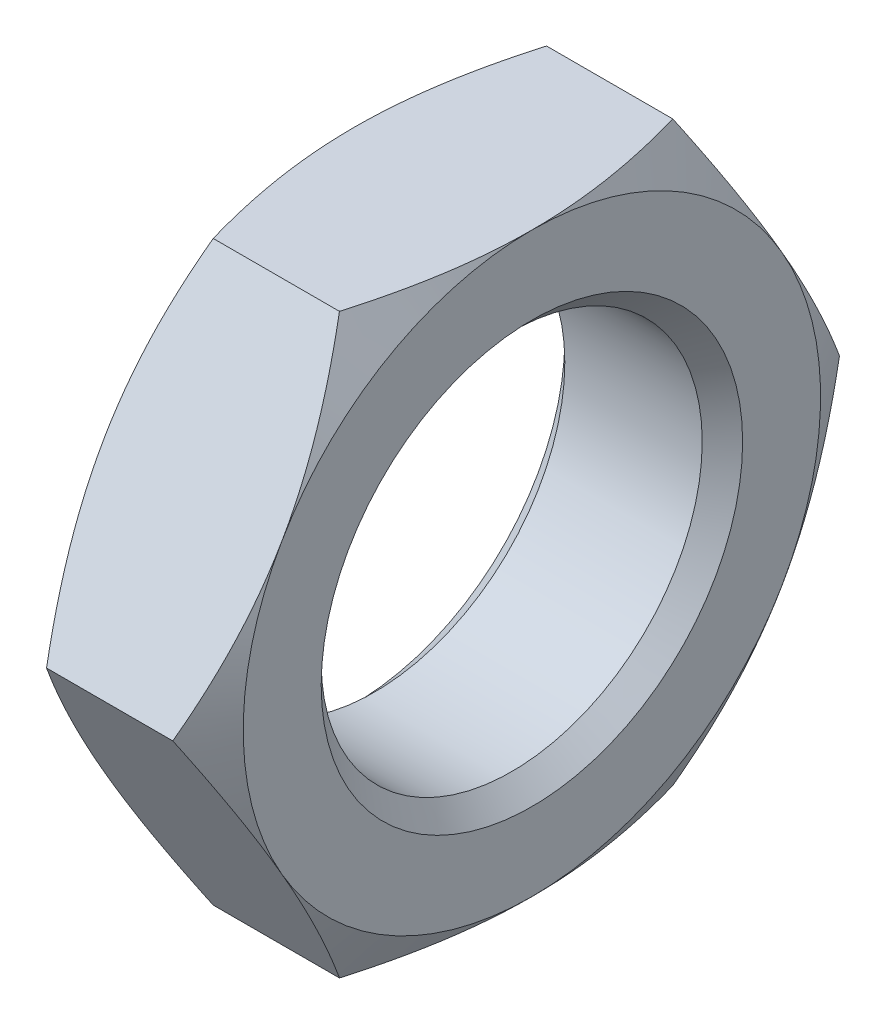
ISO-10303-21;
HEADER;
FILE_DESCRIPTION(('STEP AP214'),'2;1');
FILE_NAME('part.step','',(''),(''),'','','');
FILE_SCHEMA(('AUTOMOTIVE_DESIGN { 1 0 10303 214 1 1 1 1 }'));
ENDSEC;
DATA;
#1=APPLICATION_CONTEXT('core data for automotive mechanical design processes');
#2=APPLICATION_PROTOCOL_DEFINITION('international standard','automotive_design',2000,#1);
#3=PRODUCT_CONTEXT('',#1,'mechanical');
#4=PRODUCT('Part','Part','',(#3));
#5=PRODUCT_RELATED_PRODUCT_CATEGORY('part','',(#4));
#6=PRODUCT_DEFINITION_FORMATION('','',#4);
#7=PRODUCT_DEFINITION_CONTEXT('part definition',#1,'design');
#8=PRODUCT_DEFINITION('design','',#6,#7);
#9=PRODUCT_DEFINITION_SHAPE('','',#8);
#10=(LENGTH_UNIT() NAMED_UNIT(*) SI_UNIT(.MILLI.,.METRE.));
#11=(NAMED_UNIT(*) PLANE_ANGLE_UNIT() SI_UNIT($,.RADIAN.));
#12=(NAMED_UNIT(*) SI_UNIT($,.STERADIAN.) SOLID_ANGLE_UNIT());
#13=UNCERTAINTY_MEASURE_WITH_UNIT(LENGTH_MEASURE(1.E-05),#10,'distance_accuracy_value','');
#14=(GEOMETRIC_REPRESENTATION_CONTEXT(3) GLOBAL_UNCERTAINTY_ASSIGNED_CONTEXT((#13)) GLOBAL_UNIT_ASSIGNED_CONTEXT((#10,
#11,#12)) REPRESENTATION_CONTEXT('',''));
#15=CARTESIAN_POINT('',(0.,0.,0.));
#16=DIRECTION('',(0.,0.,1.));
#17=DIRECTION('',(1.,0.,0.));
#18=AXIS2_PLACEMENT_3D('',#15,#16,#17);
#19=CARTESIAN_POINT('',(15.4,25.,-14.4337567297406));
#20=DIRECTION('',(1.,0.,0.));
#21=DIRECTION('',(0.,0.,-1.));
#22=AXIS2_PLACEMENT_3D('',#19,#20,#21);
#23=PLANE('',#22);
#24=CARTESIAN_POINT('',(15.4,0.,0.));
#25=DIRECTION('',(1.,0.,0.));
#26=DIRECTION('',(0.,0.,-1.));
#27=AXIS2_PLACEMENT_3D('',#24,#25,#26);
#28=CIRCLE('',#27,18.25);
#29=CARTESIAN_POINT('',(15.4,0.,-18.25));
#30=VERTEX_POINT('',#29);
#31=EDGE_CURVE('E11',#30,#30,#28,.F.);
#32=ORIENTED_EDGE('',*,*,#31,.T.);
#33=EDGE_LOOP('',(#32));
#34=FACE_BOUND('',#33,.T.);
#35=CARTESIAN_POINT('',(15.4,0.,0.));
#36=DIRECTION('',(1.,0.,0.));
#37=DIRECTION('',(0.,0.,-1.));
#38=AXIS2_PLACEMENT_3D('',#35,#36,#37);
#39=CIRCLE('',#38,25.);
#40=CARTESIAN_POINT('',(15.4,-25.,0.));
#41=VERTEX_POINT('',#40);
#42=CARTESIAN_POINT('',(15.4,-12.5,-21.650635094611));
#43=VERTEX_POINT('',#42);
#44=EDGE_CURVE('E142',#41,#43,#39,.T.);
#45=ORIENTED_EDGE('',*,*,#44,.T.);
#46=CARTESIAN_POINT('',(15.4,12.5,-21.650635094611));
#47=VERTEX_POINT('',#46);
#48=EDGE_CURVE('E130',#43,#47,#39,.T.);
#49=ORIENTED_EDGE('',*,*,#48,.T.);
#50=CARTESIAN_POINT('',(15.4,25.,0.));
#51=VERTEX_POINT('',#50);
#52=EDGE_CURVE('E144',#47,#51,#39,.T.);
#53=ORIENTED_EDGE('',*,*,#52,.T.);
#54=CARTESIAN_POINT('',(15.4,12.5,21.650635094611));
#55=VERTEX_POINT('',#54);
#56=EDGE_CURVE('E55',#51,#55,#39,.T.);
#57=ORIENTED_EDGE('',*,*,#56,.T.);
#58=CARTESIAN_POINT('',(15.4,-12.5,21.650635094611));
#59=VERTEX_POINT('',#58);
#60=EDGE_CURVE('E63',#55,#59,#39,.T.);
#61=ORIENTED_EDGE('',*,*,#60,.T.);
#62=EDGE_CURVE('E166',#59,#41,#39,.T.);
#63=ORIENTED_EDGE('',*,*,#62,.T.);
#64=EDGE_LOOP('',(#45,#49,#53,#57,#61,#63));
#65=FACE_BOUND('',#64,.T.);
#66=ADVANCED_FACE('F39',(#34,#65),#23,.T.);
#67=CARTESIAN_POINT('',(0.,25.,-14.4337567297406));
#68=DIRECTION('',(1.,0.,0.));
#69=DIRECTION('',(0.,0.,-1.));
#70=AXIS2_PLACEMENT_3D('',#67,#68,#69);
#71=PLANE('',#70);
#72=CARTESIAN_POINT('',(0.,0.,0.));
#73=DIRECTION('',(1.,0.,0.));
#74=DIRECTION('',(0.,0.,-1.));
#75=AXIS2_PLACEMENT_3D('',#72,#73,#74);
#76=CIRCLE('',#75,18.25);
#77=CARTESIAN_POINT('',(0.,0.,-18.25));
#78=VERTEX_POINT('',#77);
#79=EDGE_CURVE('E164',#78,#78,#76,.T.);
#80=ORIENTED_EDGE('',*,*,#79,.T.);
#81=EDGE_LOOP('',(#80));
#82=FACE_BOUND('',#81,.T.);
#83=CARTESIAN_POINT('',(0.,0.,0.));
#84=DIRECTION('',(1.,0.,0.));
#85=DIRECTION('',(0.,0.,-1.));
#86=AXIS2_PLACEMENT_3D('',#83,#84,#85);
#87=CIRCLE('',#86,25.);
#88=CARTESIAN_POINT('',(0.,-12.5,-21.650635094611));
#89=VERTEX_POINT('',#88);
#90=CARTESIAN_POINT('',(0.,12.5,-21.650635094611));
#91=VERTEX_POINT('',#90);
#92=EDGE_CURVE('E173',#89,#91,#87,.T.);
#93=ORIENTED_EDGE('',*,*,#92,.F.);
#94=CARTESIAN_POINT('',(0.,-25.,0.));
#95=VERTEX_POINT('',#94);
#96=EDGE_CURVE('E319',#95,#89,#87,.T.);
#97=ORIENTED_EDGE('',*,*,#96,.F.);
#98=CARTESIAN_POINT('',(0.,-12.5,21.650635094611));
#99=VERTEX_POINT('',#98);
#100=EDGE_CURVE('E322',#99,#95,#87,.T.);
#101=ORIENTED_EDGE('',*,*,#100,.F.);
#102=CARTESIAN_POINT('',(0.,12.5,21.650635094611));
#103=VERTEX_POINT('',#102);
#104=EDGE_CURVE('E329',#103,#99,#87,.T.);
#105=ORIENTED_EDGE('',*,*,#104,.F.);
#106=CARTESIAN_POINT('',(0.,25.,0.));
#107=VERTEX_POINT('',#106);
#108=EDGE_CURVE('E177',#107,#103,#87,.T.);
#109=ORIENTED_EDGE('',*,*,#108,.F.);
#110=EDGE_CURVE('E174',#91,#107,#87,.T.);
#111=ORIENTED_EDGE('',*,*,#110,.F.);
#112=EDGE_LOOP('',(#93,#97,#101,#105,#109,#111));
#113=FACE_BOUND('',#112,.T.);
#114=ADVANCED_FACE('F320',(#82,#113),#71,.F.);
#115=CARTESIAN_POINT('',(15.4,0.,0.));
#116=DIRECTION('',(-1.,0.,0.));
#117=DIRECTION('',(0.,0.,1.));
#118=AXIS2_PLACEMENT_3D('',#115,#116,#117);
#119=CYLINDRICAL_SURFACE('',#118,16.5);
#120=CARTESIAN_POINT('',(1.74999999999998,0.,0.));
#121=DIRECTION('',(1.,0.,0.));
#122=DIRECTION('',(0.,0.,-1.));
#123=AXIS2_PLACEMENT_3D('',#120,#121,#122);
#124=CIRCLE('',#123,16.5);
#125=CARTESIAN_POINT('',(1.74999999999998,0.,16.5));
#126=VERTEX_POINT('',#125);
#127=EDGE_CURVE('E48',#126,#126,#124,.F.);
#128=CARTESIAN_POINT('',(13.65,0.,0.));
#129=DIRECTION('',(1.,0.,0.));
#130=DIRECTION('',(0.,0.,-1.));
#131=AXIS2_PLACEMENT_3D('',#128,#129,#130);
#132=CIRCLE('',#131,16.5);
#133=CARTESIAN_POINT('',(13.65,0.,16.5));
#134=VERTEX_POINT('',#133);
#135=EDGE_CURVE('E391',#134,#134,#132,.T.);
#136=CARTESIAN_POINT('',(1.74999999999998,0.,16.5));
#137=CARTESIAN_POINT('',(1.87395833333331,0.,16.5));
#138=CARTESIAN_POINT('',(1.99791666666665,0.,16.5));
#139=CARTESIAN_POINT('',(2.24583333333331,0.,16.5));
#140=CARTESIAN_POINT('',(2.36979166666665,0.,16.5));
#141=CARTESIAN_POINT('',(2.61770833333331,0.,16.5));
#142=CARTESIAN_POINT('',(2.74166666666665,0.,16.5));
#143=CARTESIAN_POINT('',(2.98958333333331,0.,16.5));
#144=CARTESIAN_POINT('',(3.11354166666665,0.,16.5));
#145=CARTESIAN_POINT('',(3.36145833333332,0.,16.5));
#146=CARTESIAN_POINT('',(3.48541666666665,0.,16.5));
#147=CARTESIAN_POINT('',(3.73333333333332,0.,16.5));
#148=CARTESIAN_POINT('',(3.85729166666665,0.,16.5));
#149=CARTESIAN_POINT('',(4.10520833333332,0.,16.5));
#150=CARTESIAN_POINT('',(4.22916666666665,0.,16.5));
#151=CARTESIAN_POINT('',(4.47708333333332,0.,16.5));
#152=CARTESIAN_POINT('',(4.60104166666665,0.,16.5));
#153=CARTESIAN_POINT('',(4.84895833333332,0.,16.5));
#154=CARTESIAN_POINT('',(4.97291666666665,0.,16.5));
#155=CARTESIAN_POINT('',(5.22083333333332,0.,16.5));
#156=CARTESIAN_POINT('',(5.34479166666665,0.,16.5));
#157=CARTESIAN_POINT('',(5.59270833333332,0.,16.5));
#158=CARTESIAN_POINT('',(5.71666666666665,0.,16.5));
#159=CARTESIAN_POINT('',(5.96458333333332,0.,16.5));
#160=CARTESIAN_POINT('',(6.08854166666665,0.,16.5));
#161=CARTESIAN_POINT('',(6.33645833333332,0.,16.5));
#162=CARTESIAN_POINT('',(6.46041666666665,0.,16.5));
#163=CARTESIAN_POINT('',(6.70833333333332,0.,16.5));
#164=CARTESIAN_POINT('',(6.83229166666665,0.,16.5));
#165=CARTESIAN_POINT('',(7.08020833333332,0.,16.5));
#166=CARTESIAN_POINT('',(7.20416666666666,0.,16.5));
#167=CARTESIAN_POINT('',(7.45208333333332,0.,16.5));
#168=CARTESIAN_POINT('',(7.57604166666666,0.,16.5));
#169=CARTESIAN_POINT('',(7.82395833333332,0.,16.5));
#170=CARTESIAN_POINT('',(7.94791666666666,0.,16.5));
#171=CARTESIAN_POINT('',(8.19583333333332,0.,16.5));
#172=CARTESIAN_POINT('',(8.31979166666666,0.,16.5));
#173=CARTESIAN_POINT('',(8.56770833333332,0.,16.5));
#174=CARTESIAN_POINT('',(8.69166666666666,0.,16.5));
#175=CARTESIAN_POINT('',(8.93958333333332,0.,16.5));
#176=CARTESIAN_POINT('',(9.06354166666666,0.,16.5));
#177=CARTESIAN_POINT('',(9.31145833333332,0.,16.5));
#178=CARTESIAN_POINT('',(9.43541666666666,0.,16.5));
#179=CARTESIAN_POINT('',(9.68333333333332,0.,16.5));
#180=CARTESIAN_POINT('',(9.80729166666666,0.,16.5));
#181=CARTESIAN_POINT('',(10.0552083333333,0.,16.5));
#182=CARTESIAN_POINT('',(10.1791666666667,0.,16.5));
#183=CARTESIAN_POINT('',(10.4270833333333,0.,16.5));
#184=CARTESIAN_POINT('',(10.5510416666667,0.,16.5));
#185=CARTESIAN_POINT('',(10.7989583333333,0.,16.5));
#186=CARTESIAN_POINT('',(10.9229166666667,0.,16.5));
#187=CARTESIAN_POINT('',(11.1708333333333,0.,16.5));
#188=CARTESIAN_POINT('',(11.2947916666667,0.,16.5));
#189=CARTESIAN_POINT('',(11.5427083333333,0.,16.5));
#190=CARTESIAN_POINT('',(11.6666666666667,0.,16.5));
#191=CARTESIAN_POINT('',(11.9145833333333,0.,16.5));
#192=CARTESIAN_POINT('',(12.0385416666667,0.,16.5));
#193=CARTESIAN_POINT('',(12.2864583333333,0.,16.5));
#194=CARTESIAN_POINT('',(12.4104166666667,0.,16.5));
#195=CARTESIAN_POINT('',(12.6583333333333,0.,16.5));
#196=CARTESIAN_POINT('',(12.7822916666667,0.,16.5));
#197=CARTESIAN_POINT('',(13.0302083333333,0.,16.5));
#198=CARTESIAN_POINT('',(13.1541666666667,0.,16.5));
#199=CARTESIAN_POINT('',(13.4020833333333,0.,16.5));
#200=CARTESIAN_POINT('',(13.5260416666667,0.,16.5));
#201=CARTESIAN_POINT('',(13.65,0.,16.5));
#202=B_SPLINE_CURVE_WITH_KNOTS('',3,(#136,#137,#138,#139,#140,#141,#142,#143,#144,#145,#146,
#147,#148,#149,#150,#151,#152,#153,#154,#155,#156,#157,#158,#159,#160,#161,#162,#163,#164,#165,
#166,#167,#168,#169,#170,#171,#172,#173,#174,#175,#176,#177,#178,#179,#180,#181,#182,#183,#184,
#185,#186,#187,#188,#189,#190,#191,#192,#193,#194,#195,#196,#197,#198,#199,#200,#201),
.UNSPECIFIED.,.F.,.F.,(4,2,2,2,2,2,2,2,2,2,2,2,2,2,2,2,2,2,2,2,2,2,2,2,2,2,2,2,2,2,2,2,4),(0.,
0.371875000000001,0.743750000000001,1.115625,1.4875,1.859375,2.23125,2.603125,2.97500000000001,
3.34687500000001,3.71875000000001,4.09062500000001,4.46250000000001,4.83437500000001,
5.20625000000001,5.57812500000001,5.95000000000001,6.32187500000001,6.69375000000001,
7.06562500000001,7.43750000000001,7.80937500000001,8.18125000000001,8.55312500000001,
8.92500000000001,9.29687500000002,9.66875000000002,10.040625,10.4125,10.784375,11.15625,
11.528125,11.9),.UNSPECIFIED.);
#203=EDGE_CURVE('BSEAM233',#126,#134,#202,.T.);
#204=ORIENTED_EDGE('',*,*,#127,.T.);
#205=ORIENTED_EDGE('',*,*,#135,.T.);
#206=ORIENTED_EDGE('',*,*,#203,.T.);
#207=ORIENTED_EDGE('',*,*,#203,.F.);
#208=EDGE_LOOP('',(#204,#206,#205,#207));
#209=FACE_BOUND('',#208,.T.);
#210=ADVANCED_FACE('F233',(#209),#119,.F.);
#211=CARTESIAN_POINT('',(0.,0.,0.));
#212=DIRECTION('',(1.,0.,0.));
#213=DIRECTION('',(0.,0.,-1.));
#214=AXIS2_PLACEMENT_3D('',#211,#212,#213);
#215=CONICAL_SURFACE('',#214,25.,1.0471975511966);
#216=CARTESIAN_POINT('',(2.23297660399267,-25.0002,-14.4336412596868));
#217=CARTESIAN_POINT('',(2.04982704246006,-24.4507109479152,-14.7508889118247));
#218=CARTESIAN_POINT('',(1.87498859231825,-23.8990785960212,-15.0693739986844));
#219=CARTESIAN_POINT('',(1.54424409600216,-22.7913904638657,-15.7088980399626));
#220=CARTESIAN_POINT('',(1.38834427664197,-22.2353332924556,-16.029937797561));
#221=CARTESIAN_POINT('',(1.09756958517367,-21.1177090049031,-16.6751984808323));
#222=CARTESIAN_POINT('',(0.962744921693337,-20.5561320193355,-16.9994251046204));
#223=CARTESIAN_POINT('',(0.717024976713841,-19.4290997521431,-17.6501174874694));
#224=CARTESIAN_POINT('',(0.606127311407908,-18.8636448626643,-17.9765830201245));
#225=CARTESIAN_POINT('',(0.412968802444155,-17.7433102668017,-18.6234085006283));
#226=CARTESIAN_POINT('',(0.330069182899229,-17.1885136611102,-18.9437204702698));
#227=CARTESIAN_POINT('',(0.191065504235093,-16.0763783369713,-19.5858120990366));
#228=CARTESIAN_POINT('',(0.134961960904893,-15.5190395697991,-19.9075917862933));
#229=CARTESIAN_POINT('',(0.0509670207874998,-14.4034258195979,-20.5516916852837));
#230=CARTESIAN_POINT('',(0.0230421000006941,-13.8451527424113,-20.8740107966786));
#231=CARTESIAN_POINT('',(-0.00399507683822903,-12.7280914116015,-21.518946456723));
#232=CARTESIAN_POINT('',(-0.00310822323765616,-12.1693031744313,-21.8415629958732));
#233=CARTESIAN_POINT('',(0.0254657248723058,-11.1246404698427,-22.4446992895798));
#234=CARTESIAN_POINT('',(0.0496684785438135,-10.6386915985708,-22.725262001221));
#235=CARTESIAN_POINT('',(0.119404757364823,-9.66795399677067,-23.2857176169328));
#236=CARTESIAN_POINT('',(0.164937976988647,-9.18316524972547,-23.5656105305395));
#237=CARTESIAN_POINT('',(0.276546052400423,-8.21492701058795,-24.1246231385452));
#238=CARTESIAN_POINT('',(0.342639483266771,-7.73147912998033,-24.4037419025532));
#239=CARTESIAN_POINT('',(0.494198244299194,-6.76689819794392,-24.9606429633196));
#240=CARTESIAN_POINT('',(0.579663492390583,-6.28576513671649,-25.2384252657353));
#241=CARTESIAN_POINT('',(0.867310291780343,-4.8251476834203,-26.0817131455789));
#242=CARTESIAN_POINT('',(1.09818903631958,-3.84981315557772,-26.6448227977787));
#243=CARTESIAN_POINT('',(1.49124920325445,-2.3975824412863,-27.4832685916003));
#244=CARTESIAN_POINT('',(1.62991816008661,-1.91571684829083,-27.7614738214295));
#245=CARTESIAN_POINT('',(1.9212945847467,-0.955318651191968,-28.3159599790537));
#246=CARTESIAN_POINT('',(2.0739980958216,-0.476785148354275,-28.5922414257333));
#247=CARTESIAN_POINT('',(2.23297660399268,0.000200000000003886,-28.8676289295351));
#248=B_SPLINE_CURVE_WITH_KNOTS('',3,(#216,#217,#218,#219,#220,#221,#222,#223,#224,#225,#226,
#227,#228,#229,#230,#231,#232,#233,#234,#235,#236,#237,#238,#239,#240,#241,#242,#243,#244,#245,
#246,#247),.UNSPECIFIED.,.F.,.F.,(4,2,2,2,2,2,2,2,2,2,2,2,2,2,2,4),(0.,1.98125159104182,
3.9631528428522,5.94970601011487,7.93606116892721,9.87343019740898,11.8108365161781,
13.7459351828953,15.6809740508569,17.3655086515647,19.0500191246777,20.7360559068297,
22.4220855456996,25.8684114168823,27.588572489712,29.3082500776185),.UNSPECIFIED.);
#249=CARTESIAN_POINT('',(2.23290993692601,0.,-28.8675134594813));
#250=VERTEX_POINT('',#249);
#251=EDGE_CURVE('E335',#89,#250,#248,.T.);
#252=ORIENTED_EDGE('',*,*,#251,.F.);
#253=ORIENTED_EDGE('',*,*,#92,.T.);
#254=CARTESIAN_POINT('',(2.23297660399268,-0.000199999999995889,-28.8676289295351));
#255=CARTESIAN_POINT('',(2.04982704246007,0.549289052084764,-28.5503812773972));
#256=CARTESIAN_POINT('',(1.87498859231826,1.10092140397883,-28.2318961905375));
#257=CARTESIAN_POINT('',(1.54424409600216,2.20860953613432,-27.5923721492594));
#258=CARTESIAN_POINT('',(1.38834427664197,2.76466670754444,-27.2713323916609));
#259=CARTESIAN_POINT('',(1.09756958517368,3.88229099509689,-26.6260717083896));
#260=CARTESIAN_POINT('',(0.962744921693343,4.44386798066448,-26.3018450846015));
#261=CARTESIAN_POINT('',(0.717024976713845,5.57090024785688,-25.6511527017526));
#262=CARTESIAN_POINT('',(0.606127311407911,6.13635513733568,-25.3246871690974));
#263=CARTESIAN_POINT('',(0.412968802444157,7.25668973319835,-24.6778616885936));
#264=CARTESIAN_POINT('',(0.330069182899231,7.81148633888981,-24.3575497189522));
#265=CARTESIAN_POINT('',(0.191065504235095,8.92362166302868,-23.7154580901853));
#266=CARTESIAN_POINT('',(0.134961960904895,9.48096043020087,-23.3936784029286));
#267=CARTESIAN_POINT('',(0.0509670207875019,10.5965741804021,-22.7495785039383));
#268=CARTESIAN_POINT('',(0.0230421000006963,11.1548472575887,-22.4272593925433));
#269=CARTESIAN_POINT('',(-0.00399507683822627,12.2719085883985,-21.7823237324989));
#270=CARTESIAN_POINT('',(-0.0031082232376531,12.8306968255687,-21.4597071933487));
#271=CARTESIAN_POINT('',(0.0254657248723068,13.8753595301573,-20.8565708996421));
#272=CARTESIAN_POINT('',(0.0496684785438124,14.3613084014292,-20.5760081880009));
#273=CARTESIAN_POINT('',(0.11940475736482,15.3320460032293,-20.0155525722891));
#274=CARTESIAN_POINT('',(0.164937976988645,15.8168347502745,-19.7356596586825));
#275=CARTESIAN_POINT('',(0.276546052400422,16.7850729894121,-19.1766470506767));
#276=CARTESIAN_POINT('',(0.342639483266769,17.2685208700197,-18.8975282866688));
#277=CARTESIAN_POINT('',(0.494198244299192,18.2331018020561,-18.3406272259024));
#278=CARTESIAN_POINT('',(0.57966349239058,18.7142348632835,-18.0628449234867));
#279=CARTESIAN_POINT('',(0.867310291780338,20.1748523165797,-17.2195570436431));
#280=CARTESIAN_POINT('',(1.09818903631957,21.1501868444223,-16.6564473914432));
#281=CARTESIAN_POINT('',(1.49124920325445,22.6024175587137,-15.8180015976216));
#282=CARTESIAN_POINT('',(1.6299181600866,23.0842831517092,-15.5397963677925));
#283=CARTESIAN_POINT('',(1.92129458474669,24.044681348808,-14.9853102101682));
#284=CARTESIAN_POINT('',(2.0739980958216,24.5232148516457,-14.7090287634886));
#285=CARTESIAN_POINT('',(2.23297660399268,25.0002,-14.4336412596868));
#286=B_SPLINE_CURVE_WITH_KNOTS('',3,(#254,#255,#256,#257,#258,#259,#260,#261,#262,#263,#264,
#265,#266,#267,#268,#269,#270,#271,#272,#273,#274,#275,#276,#277,#278,#279,#280,#281,#282,#283,
#284,#285),.UNSPECIFIED.,.F.,.F.,(4,2,2,2,2,2,2,2,2,2,2,2,2,2,2,4),(0.,1.98125159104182,
3.96315284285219,5.94970601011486,7.93606116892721,9.87343019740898,11.8108365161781,
13.7459351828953,15.6809740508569,17.3655086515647,19.0500191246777,20.7360559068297,
22.4220855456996,25.8684114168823,27.5885724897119,29.3082500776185),.UNSPECIFIED.);
#287=EDGE_CURVE('E214',#250,#91,#286,.T.);
#288=ORIENTED_EDGE('',*,*,#287,.F.);
#289=EDGE_LOOP('',(#252,#253,#288));
#290=FACE_BOUND('',#289,.T.);
#291=ADVANCED_FACE('F193',(#290),#215,.T.);
#292=ORIENTED_EDGE('',*,*,#96,.T.);
#293=CARTESIAN_POINT('',(2.23290993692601,-25.,-14.4337567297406));
#294=VERTEX_POINT('',#293);
#295=EDGE_CURVE('E156',#294,#89,#248,.T.);
#296=ORIENTED_EDGE('',*,*,#295,.F.);
#297=CARTESIAN_POINT('',(12.3333296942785,-25.,-39.0439591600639));
#298=CARTESIAN_POINT('',(12.0673346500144,-25.,-38.4968747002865));
#299=CARTESIAN_POINT('',(11.8026417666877,-25.,-37.9491552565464));
#300=CARTESIAN_POINT('',(11.2761629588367,-25.,-36.8523147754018));
#301=CARTESIAN_POINT('',(11.0143770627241,-25.,-36.3031937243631));
#302=CARTESIAN_POINT('',(10.4939809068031,-25.,-35.2033463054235));
#303=CARTESIAN_POINT('',(10.2353711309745,-25.,-34.6526197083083));
#304=CARTESIAN_POINT('',(9.72173144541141,-25.,-33.5495019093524));
#305=CARTESIAN_POINT('',(9.46670152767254,-25.,-32.9971107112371));
#306=CARTESIAN_POINT('',(8.70488044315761,-25.,-31.331319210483));
#307=CARTESIAN_POINT('',(8.2041325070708,-25.,-30.2151437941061));
#308=CARTESIAN_POINT('',(7.22273801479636,-25.,-27.974007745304));
#309=CARTESIAN_POINT('',(6.74209052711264,-25.,-26.8490475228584));
#310=CARTESIAN_POINT('',(6.03249574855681,-25.,-25.1349848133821));
#311=CARTESIAN_POINT('',(5.79420139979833,-25.,-24.5497483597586));
#312=CARTESIAN_POINT('',(5.32534749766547,-25.,-23.3761889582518));
#313=CARTESIAN_POINT('',(5.09478783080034,-25.,-22.7878660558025));
#314=CARTESIAN_POINT('',(4.64241361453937,-25.,-21.6077647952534));
#315=CARTESIAN_POINT('',(4.42060032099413,-25.,-21.0159859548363));
#316=CARTESIAN_POINT('',(3.98696928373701,-25.,-19.8287866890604));
#317=CARTESIAN_POINT('',(3.77515132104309,-25.,-19.2333663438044));
#318=CARTESIAN_POINT('',(3.363292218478,-25.,-18.0397716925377));
#319=CARTESIAN_POINT('',(3.16322850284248,-25.,-17.4416052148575));
#320=CARTESIAN_POINT('',(2.77599273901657,-25.,-16.2411254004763));
#321=CARTESIAN_POINT('',(2.588820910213,-25.,-15.6388119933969));
#322=CARTESIAN_POINT('',(2.0493021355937,-25.,-13.8256050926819));
#323=CARTESIAN_POINT('',(1.71879427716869,-25.,-12.6079957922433));
#324=CARTESIAN_POINT('',(1.27955362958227,-25.,-10.7718095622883));
#325=CARTESIAN_POINT('',(1.14286587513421,-25.,-10.159852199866));
#326=CARTESIAN_POINT('',(0.889930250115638,-25.,-8.93170083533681));
#327=CARTESIAN_POINT('',(0.77368197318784,-25.,-8.31550691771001));
#328=CARTESIAN_POINT('',(0.563662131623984,-25.,-7.07930589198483));
#329=CARTESIAN_POINT('',(0.469889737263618,-25.,-6.45929892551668));
#330=CARTESIAN_POINT('',(0.306675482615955,-25.,-5.21606840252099));
#331=CARTESIAN_POINT('',(0.23723360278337,-25.,-4.59284484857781));
#332=CARTESIAN_POINT('',(0.124952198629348,-25.,-3.352343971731));
#333=CARTESIAN_POINT('',(0.0817713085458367,-25.,-2.73509773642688));
#334=CARTESIAN_POINT('',(0.0215649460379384,-25.,-1.49933250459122));
#335=CARTESIAN_POINT('',(0.00453903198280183,-25.,-0.880813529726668));
#336=CARTESIAN_POINT('',(-0.00295125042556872,-25.,0.356390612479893));
#337=CARTESIAN_POINT('',(0.00658441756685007,-25.,0.975075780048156));
#338=CARTESIAN_POINT('',(0.0519813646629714,-25.,2.21148677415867));
#339=CARTESIAN_POINT('',(0.0878438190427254,-25.,2.82921255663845));
#340=CARTESIAN_POINT('',(0.204250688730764,-25.,4.30561108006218));
#341=CARTESIAN_POINT('',(0.296830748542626,-25.,5.1633521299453));
#342=CARTESIAN_POINT('',(0.527772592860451,-25.,6.87265221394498));
#343=CARTESIAN_POINT('',(0.666140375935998,-25.,7.72421042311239));
#344=CARTESIAN_POINT('',(0.983735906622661,-25.,9.42027064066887));
#345=CARTESIAN_POINT('',(1.16299469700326,-25.,10.2647667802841));
#346=CARTESIAN_POINT('',(1.55688671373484,-25.,11.9453782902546));
#347=CARTESIAN_POINT('',(1.77151946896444,-25.,12.7814937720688));
#348=CARTESIAN_POINT('',(2.23603883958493,-25.,14.4638967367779));
#349=CARTESIAN_POINT('',(2.48660480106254,-25.,15.3099953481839));
#350=CARTESIAN_POINT('',(3.01417663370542,-25.,16.9938601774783));
#351=CARTESIAN_POINT('',(3.29118268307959,-25.,17.8316263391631));
#352=CARTESIAN_POINT('',(3.86719015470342,-25.,19.4992382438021));
#353=CARTESIAN_POINT('',(4.16618463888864,-25.,20.3290863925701));
#354=CARTESIAN_POINT('',(4.62849212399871,-25.,21.5686648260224));
#355=CARTESIAN_POINT('',(4.7848971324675,-25.,21.9809917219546));
#356=CARTESIAN_POINT('',(5.10193217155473,-25.,22.8040197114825));
#357=CARTESIAN_POINT('',(5.26256221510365,-25.,23.2147208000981));
#358=CARTESIAN_POINT('',(5.8834337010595,-25.,24.7804701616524));
#359=CARTESIAN_POINT('',(6.35705051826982,-25.,25.9302284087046));
#360=CARTESIAN_POINT('',(7.32817597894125,-25.,28.2196287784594));
#361=CARTESIAN_POINT('',(7.82568625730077,-25.,29.3592702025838));
#362=CARTESIAN_POINT('',(8.83971135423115,-25.,31.6303844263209));
#363=CARTESIAN_POINT('',(9.35623083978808,-25.,32.7618551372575));
#364=CARTESIAN_POINT('',(10.4043459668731,-25.,35.0177397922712));
#365=CARTESIAN_POINT('',(10.9359412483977,-25.,36.1421539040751));
#366=CARTESIAN_POINT('',(12.0119613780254,-25.,38.3864448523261));
#367=CARTESIAN_POINT('',(12.5564005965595,-25.,39.5063147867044));
#368=CARTESIAN_POINT('',(13.6552690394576,-25.,41.7411419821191));
#369=CARTESIAN_POINT('',(14.2096983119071,-25.,42.856099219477));
#370=CARTESIAN_POINT('',(15.3267243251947,-25.,45.0817154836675));
#371=CARTESIAN_POINT('',(15.8893199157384,-25.,46.1923750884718));
#372=CARTESIAN_POINT('',(17.021381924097,-25.,48.410181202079));
#373=CARTESIAN_POINT('',(17.5908483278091,-25.,49.5173277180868));
#374=CARTESIAN_POINT('',(18.6858446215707,-25.,51.6325843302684));
#375=CARTESIAN_POINT('',(19.2108941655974,-25.,52.64094327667));
#376=CARTESIAN_POINT('',(20.2651466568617,-25.,54.6554883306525));
#377=CARTESIAN_POINT('',(20.7943496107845,-25.,55.6616744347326));
#378=CARTESIAN_POINT('',(22.3873642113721,-25.,58.67747150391));
#379=CARTESIAN_POINT('',(23.4565437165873,-25.,60.6842482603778));
#380=CARTESIAN_POINT('',(25.0670627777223,-25.,63.6873613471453));
#381=CARTESIAN_POINT('',(25.6043079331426,-25.,64.6858993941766));
#382=CARTESIAN_POINT('',(26.6812038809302,-25.,66.6816785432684));
#383=CARTESIAN_POINT('',(27.2208546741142,-25.,67.6789196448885));
#384=CARTESIAN_POINT('',(28.3022468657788,-25.,69.6721913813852));
#385=CARTESIAN_POINT('',(28.8439881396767,-25.,70.6682220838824));
#386=CARTESIAN_POINT('',(29.9293642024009,-25.,72.6592493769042));
#387=CARTESIAN_POINT('',(30.4729989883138,-25.,73.6542459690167));
#388=CARTESIAN_POINT('',(31.0174670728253,-25.,74.6487858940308));
#389=B_SPLINE_CURVE_WITH_KNOTS('',3,(#297,#298,#299,#300,#301,#302,#303,#304,#305,#306,#307,
#308,#309,#310,#311,#312,#313,#314,#315,#316,#317,#318,#319,#320,#321,#322,#323,#324,#325,#326,
#327,#328,#329,#330,#331,#332,#333,#334,#335,#336,#337,#338,#339,#340,#341,#342,#343,#344,#345,
#346,#347,#348,#349,#350,#351,#352,#353,#354,#355,#356,#357,#358,#359,#360,#361,#362,#363,#364,
#365,#366,#367,#368,#369,#370,#371,#372,#373,#374,#375,#376,#377,#378,#379,#380,#381,#382,#383,
#384,#385,#386,#387,#388),.UNSPECIFIED.,.F.,.F.,(4,2,2,2,2,2,2,2,2,2,2,2,2,2,2,2,2,2,2,2,2,2,2,
2,2,2,2,2,2,2,2,2,2,2,2,2,2,2,2,2,2,2,2,2,2,4),(0.,1.82496448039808,3.64994678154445,
5.4752038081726,7.30045675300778,10.970365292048,14.6401035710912,16.5357310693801,
18.4313307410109,20.3272016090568,22.2230309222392,24.1150912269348,26.0071837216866,
29.7899419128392,31.6707784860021,33.5515776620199,35.4323073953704,37.313035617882,
39.1687624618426,41.0244579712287,42.8801560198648,44.7359369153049,47.3226803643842,
49.9097628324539,52.4988158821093,55.0878344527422,57.7345800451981,60.3813434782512,
63.0272753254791,64.3502394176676,65.6732075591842,69.4032647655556,73.1335775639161,
76.8648123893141,80.5959581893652,84.3314976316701,88.067055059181,91.8020913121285,
95.5371198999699,98.947707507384,102.358300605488,109.179733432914,112.581407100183,
115.98308192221,119.384557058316,122.786026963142),.UNSPECIFIED.);
#390=EDGE_CURVE('E176',#95,#294,#389,.F.);
#391=ORIENTED_EDGE('',*,*,#390,.F.);
#392=EDGE_LOOP('',(#292,#296,#391));
#393=FACE_BOUND('',#392,.T.);
#394=ADVANCED_FACE('F351',(#393),#215,.T.);
#395=CARTESIAN_POINT('',(7.7,0.,0.));
#396=DIRECTION('',(-1.,0.,0.));
#397=DIRECTION('',(0.,0.,1.));
#398=AXIS2_PLACEMENT_3D('',#395,#396,#397);
#399=CONICAL_SURFACE('',#398,38.3367912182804,1.0471975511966);
#400=CARTESIAN_POINT('',(13.1670233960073,0.000200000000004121,-28.8676289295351));
#401=CARTESIAN_POINT('',(13.3501729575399,-0.549289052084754,-28.5503812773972));
#402=CARTESIAN_POINT('',(13.5250114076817,-1.10092140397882,-28.2318961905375));
#403=CARTESIAN_POINT('',(13.8557559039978,-2.20860953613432,-27.5923721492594));
#404=CARTESIAN_POINT('',(14.011655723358,-2.76466670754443,-27.2713323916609));
#405=CARTESIAN_POINT('',(14.3024304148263,-3.88229099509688,-26.6260717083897));
#406=CARTESIAN_POINT('',(14.4372550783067,-4.44386798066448,-26.3018450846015));
#407=CARTESIAN_POINT('',(14.6829750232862,-5.57090024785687,-25.6511527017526));
#408=CARTESIAN_POINT('',(14.7938726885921,-6.13635513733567,-25.3246871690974));
#409=CARTESIAN_POINT('',(14.9870311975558,-7.25668973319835,-24.6778616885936));
#410=CARTESIAN_POINT('',(15.0699308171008,-7.81148633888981,-24.3575497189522));
#411=CARTESIAN_POINT('',(15.2089344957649,-8.92362166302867,-23.7154580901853));
#412=CARTESIAN_POINT('',(15.2650380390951,-9.48096043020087,-23.3936784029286));
#413=CARTESIAN_POINT('',(15.3490329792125,-10.5965741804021,-22.7495785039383));
#414=CARTESIAN_POINT('',(15.3769578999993,-11.1548472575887,-22.4272593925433));
#415=CARTESIAN_POINT('',(15.4039950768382,-12.2719085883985,-21.7823237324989));
#416=CARTESIAN_POINT('',(15.4031082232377,-12.8306968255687,-21.4597071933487));
#417=CARTESIAN_POINT('',(15.3745342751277,-13.8753595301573,-20.8565708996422));
#418=CARTESIAN_POINT('',(15.3503315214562,-14.3613084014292,-20.5760081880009));
#419=CARTESIAN_POINT('',(15.2805952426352,-15.3320460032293,-20.0155525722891));
#420=CARTESIAN_POINT('',(15.2350620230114,-15.8168347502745,-19.7356596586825));
#421=CARTESIAN_POINT('',(15.1234539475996,-16.785072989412,-19.1766470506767));
#422=CARTESIAN_POINT('',(15.0573605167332,-17.2685208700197,-18.8975282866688));
#423=CARTESIAN_POINT('',(14.9058017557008,-18.2331018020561,-18.3406272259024));
#424=CARTESIAN_POINT('',(14.8203365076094,-18.7142348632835,-18.0628449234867));
#425=CARTESIAN_POINT('',(14.5326897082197,-20.1748523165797,-17.2195570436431));
#426=CARTESIAN_POINT('',(14.3018109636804,-21.1501868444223,-16.6564473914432));
#427=CARTESIAN_POINT('',(13.9087507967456,-22.6024175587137,-15.8180015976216));
#428=CARTESIAN_POINT('',(13.7700818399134,-23.0842831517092,-15.5397963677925));
#429=CARTESIAN_POINT('',(13.4787054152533,-24.044681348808,-14.9853102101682));
#430=CARTESIAN_POINT('',(13.3260019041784,-24.5232148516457,-14.7090287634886));
#431=CARTESIAN_POINT('',(13.1670233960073,-25.0002,-14.4336412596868));
#432=B_SPLINE_CURVE_WITH_KNOTS('',3,(#400,#401,#402,#403,#404,#405,#406,#407,#408,#409,#410,
#411,#412,#413,#414,#415,#416,#417,#418,#419,#420,#421,#422,#423,#424,#425,#426,#427,#428,#429,
#430,#431),.UNSPECIFIED.,.F.,.F.,(4,2,2,2,2,2,2,2,2,2,2,2,2,2,2,4),(0.,1.98125159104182,
3.96315284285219,5.94970601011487,7.93606116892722,9.87343019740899,11.8108365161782,
13.7459351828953,15.6809740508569,17.3655086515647,19.0500191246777,20.7360559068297,
22.4220855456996,25.8684114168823,27.5885724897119,29.3082500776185),.UNSPECIFIED.);
#433=CARTESIAN_POINT('',(13.167090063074,-25.,-14.4337567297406));
#434=VERTEX_POINT('',#433);
#435=EDGE_CURVE('E147',#43,#434,#432,.T.);
#436=ORIENTED_EDGE('',*,*,#435,.F.);
#437=ORIENTED_EDGE('',*,*,#44,.F.);
#438=CARTESIAN_POINT('',(3.06667030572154,-25.,-39.0439591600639));
#439=CARTESIAN_POINT('',(3.33266534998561,-25.,-38.4968747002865));
#440=CARTESIAN_POINT('',(3.59735823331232,-25.,-37.9491552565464));
#441=CARTESIAN_POINT('',(4.1238370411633,-25.,-36.8523147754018));
#442=CARTESIAN_POINT('',(4.38562293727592,-25.,-36.3031937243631));
#443=CARTESIAN_POINT('',(4.90601909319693,-25.,-35.2033463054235));
#444=CARTESIAN_POINT('',(5.16462886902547,-25.,-34.6526197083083));
#445=CARTESIAN_POINT('',(5.67826855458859,-25.,-33.5495019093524));
#446=CARTESIAN_POINT('',(5.93329847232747,-25.,-32.9971107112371));
#447=CARTESIAN_POINT('',(6.69511955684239,-25.,-31.331319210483));
#448=CARTESIAN_POINT('',(7.1958674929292,-25.,-30.2151437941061));
#449=CARTESIAN_POINT('',(8.17726198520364,-25.,-27.974007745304));
#450=CARTESIAN_POINT('',(8.65790947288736,-25.,-26.8490475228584));
#451=CARTESIAN_POINT('',(9.3675042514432,-25.,-25.1349848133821));
#452=CARTESIAN_POINT('',(9.60579860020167,-25.,-24.5497483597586));
#453=CARTESIAN_POINT('',(10.0746525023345,-25.,-23.3761889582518));
#454=CARTESIAN_POINT('',(10.3052121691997,-25.,-22.7878660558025));
#455=CARTESIAN_POINT('',(10.7575863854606,-25.,-21.6077647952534));
#456=CARTESIAN_POINT('',(10.9793996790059,-25.,-21.0159859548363));
#457=CARTESIAN_POINT('',(11.413030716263,-25.,-19.8287866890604));
#458=CARTESIAN_POINT('',(11.6248486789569,-25.,-19.2333663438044));
#459=CARTESIAN_POINT('',(12.036707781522,-25.,-18.0397716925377));
#460=CARTESIAN_POINT('',(12.2367714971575,-25.,-17.4416052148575));
#461=CARTESIAN_POINT('',(12.6240072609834,-25.,-16.2411254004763));
#462=CARTESIAN_POINT('',(12.811179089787,-25.,-15.6388119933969));
#463=CARTESIAN_POINT('',(13.3506978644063,-25.,-13.8256050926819));
#464=CARTESIAN_POINT('',(13.6812057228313,-25.,-12.6079957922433));
#465=CARTESIAN_POINT('',(14.1204463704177,-25.,-10.7718095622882));
#466=CARTESIAN_POINT('',(14.2571341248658,-25.,-10.159852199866));
#467=CARTESIAN_POINT('',(14.5100697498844,-25.,-8.9317008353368));
#468=CARTESIAN_POINT('',(14.6263180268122,-25.,-8.31550691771));
#469=CARTESIAN_POINT('',(14.836337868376,-25.,-7.07930589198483));
#470=CARTESIAN_POINT('',(14.9301102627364,-25.,-6.45929892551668));
#471=CARTESIAN_POINT('',(15.093324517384,-25.,-5.21606840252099));
#472=CARTESIAN_POINT('',(15.1627663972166,-25.,-4.59284484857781));
#473=CARTESIAN_POINT('',(15.2750478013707,-25.,-3.352343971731));
#474=CARTESIAN_POINT('',(15.3182286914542,-25.,-2.73509773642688));
#475=CARTESIAN_POINT('',(15.3784350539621,-25.,-1.49933250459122));
#476=CARTESIAN_POINT('',(15.3954609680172,-25.,-0.88081352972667));
#477=CARTESIAN_POINT('',(15.4029512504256,-25.,0.356390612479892));
#478=CARTESIAN_POINT('',(15.3934155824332,-25.,0.975075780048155));
#479=CARTESIAN_POINT('',(15.348018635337,-25.,2.21148677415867));
#480=CARTESIAN_POINT('',(15.3121561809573,-25.,2.82921255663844));
#481=CARTESIAN_POINT('',(15.1957493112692,-25.,4.30561108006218));
#482=CARTESIAN_POINT('',(15.1031692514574,-25.,5.1633521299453));
#483=CARTESIAN_POINT('',(14.8722274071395,-25.,6.87265221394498));
#484=CARTESIAN_POINT('',(14.733859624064,-25.,7.72421042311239));
#485=CARTESIAN_POINT('',(14.4162640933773,-25.,9.42027064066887));
#486=CARTESIAN_POINT('',(14.2370053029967,-25.,10.2647667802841));
#487=CARTESIAN_POINT('',(13.8431132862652,-25.,11.9453782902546));
#488=CARTESIAN_POINT('',(13.6284805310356,-25.,12.7814937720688));
#489=CARTESIAN_POINT('',(13.1639611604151,-25.,14.4638967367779));
#490=CARTESIAN_POINT('',(12.9133951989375,-25.,15.3099953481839));
#491=CARTESIAN_POINT('',(12.3858233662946,-25.,16.9938601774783));
#492=CARTESIAN_POINT('',(12.1088173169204,-25.,17.8316263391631));
#493=CARTESIAN_POINT('',(11.5328098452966,-25.,19.4992382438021));
#494=CARTESIAN_POINT('',(11.2338153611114,-25.,20.3290863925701));
#495=CARTESIAN_POINT('',(10.7715078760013,-25.,21.5686648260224));
#496=CARTESIAN_POINT('',(10.6151028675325,-25.,21.9809917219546));
#497=CARTESIAN_POINT('',(10.2980678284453,-25.,22.8040197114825));
#498=CARTESIAN_POINT('',(10.1374377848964,-25.,23.2147208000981));
#499=CARTESIAN_POINT('',(9.5165662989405,-25.,24.7804701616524));
#500=CARTESIAN_POINT('',(9.04294948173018,-25.,25.9302284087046));
#501=CARTESIAN_POINT('',(8.07182402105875,-25.,28.2196287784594));
#502=CARTESIAN_POINT('',(7.57431374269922,-25.,29.3592702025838));
#503=CARTESIAN_POINT('',(6.56028864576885,-25.,31.6303844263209));
#504=CARTESIAN_POINT('',(6.04376916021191,-25.,32.7618551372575));
#505=CARTESIAN_POINT('',(4.99565403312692,-25.,35.0177397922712));
#506=CARTESIAN_POINT('',(4.46405875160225,-25.,36.1421539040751));
#507=CARTESIAN_POINT('',(3.38803862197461,-25.,38.3864448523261));
#508=CARTESIAN_POINT('',(2.8435994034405,-25.,39.5063147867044));
#509=CARTESIAN_POINT('',(1.74473096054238,-25.,41.7411419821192));
#510=CARTESIAN_POINT('',(1.1903016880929,-25.,42.8560992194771));
#511=CARTESIAN_POINT('',(0.0732756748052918,-25.,45.0817154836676));
#512=CARTESIAN_POINT('',(-0.489319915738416,-25.,46.1923750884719));
#513=CARTESIAN_POINT('',(-1.62138192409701,-25.,48.410181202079));
#514=CARTESIAN_POINT('',(-2.19084832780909,-25.,49.5173277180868));
#515=CARTESIAN_POINT('',(-3.28584462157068,-25.,51.6325843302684));
#516=CARTESIAN_POINT('',(-3.81089416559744,-25.,52.6409432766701));
#517=CARTESIAN_POINT('',(-4.86514665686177,-25.,54.6554883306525));
#518=CARTESIAN_POINT('',(-5.39434961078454,-25.,55.6616744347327));
#519=CARTESIAN_POINT('',(-6.9873642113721,-25.,58.6774715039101));
#520=CARTESIAN_POINT('',(-8.05654371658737,-25.,60.6842482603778));
#521=CARTESIAN_POINT('',(-9.66706277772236,-25.,63.6873613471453));
#522=CARTESIAN_POINT('',(-10.2043079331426,-25.,64.6858993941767));
#523=CARTESIAN_POINT('',(-11.2812038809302,-25.,66.6816785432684));
#524=CARTESIAN_POINT('',(-11.8208546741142,-25.,67.6789196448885));
#525=CARTESIAN_POINT('',(-12.9022468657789,-25.,69.6721913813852));
#526=CARTESIAN_POINT('',(-13.4439881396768,-25.,70.6682220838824));
#527=CARTESIAN_POINT('',(-14.5293642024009,-25.,72.6592493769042));
#528=CARTESIAN_POINT('',(-15.0729989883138,-25.,73.6542459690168));
#529=CARTESIAN_POINT('',(-15.6174670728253,-25.,74.6487858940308));
#530=B_SPLINE_CURVE_WITH_KNOTS('',3,(#438,#439,#440,#441,#442,#443,#444,#445,#446,#447,#448,
#449,#450,#451,#452,#453,#454,#455,#456,#457,#458,#459,#460,#461,#462,#463,#464,#465,#466,#467,
#468,#469,#470,#471,#472,#473,#474,#475,#476,#477,#478,#479,#480,#481,#482,#483,#484,#485,#486,
#487,#488,#489,#490,#491,#492,#493,#494,#495,#496,#497,#498,#499,#500,#501,#502,#503,#504,#505,
#506,#507,#508,#509,#510,#511,#512,#513,#514,#515,#516,#517,#518,#519,#520,#521,#522,#523,#524,
#525,#526,#527,#528,#529),.UNSPECIFIED.,.F.,.F.,(4,2,2,2,2,2,2,2,2,2,2,2,2,2,2,2,2,2,2,2,2,2,2,
2,2,2,2,2,2,2,2,2,2,2,2,2,2,2,2,2,2,2,2,2,2,4),(0.,1.82496448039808,3.64994678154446,
5.47520380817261,7.30045675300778,10.970365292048,14.6401035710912,16.5357310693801,
18.4313307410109,20.3272016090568,22.2230309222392,24.1150912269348,26.0071837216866,
29.7899419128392,31.6707784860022,33.5515776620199,35.4323073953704,37.313035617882,
39.1687624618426,41.0244579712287,42.8801560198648,44.7359369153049,47.3226803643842,
49.9097628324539,52.4988158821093,55.0878344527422,57.7345800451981,60.3813434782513,
63.0272753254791,64.3502394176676,65.6732075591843,69.4032647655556,73.1335775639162,
76.8648123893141,80.5959581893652,84.3314976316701,88.0670550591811,91.8020913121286,
95.53711989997,98.9477075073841,102.358300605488,109.179733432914,112.581407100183,
115.98308192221,119.384557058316,122.786026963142),.UNSPECIFIED.);
#531=EDGE_CURVE('E151',#434,#41,#530,.T.);
#532=ORIENTED_EDGE('',*,*,#531,.F.);
#533=EDGE_LOOP('',(#436,#437,#532));
#534=FACE_BOUND('',#533,.T.);
#535=ADVANCED_FACE('F148',(#534),#399,.T.);
#536=ORIENTED_EDGE('',*,*,#48,.F.);
#537=CARTESIAN_POINT('',(13.167090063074,0.,-28.8675134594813));
#538=VERTEX_POINT('',#537);
#539=EDGE_CURVE('E134',#538,#43,#432,.T.);
#540=ORIENTED_EDGE('',*,*,#539,.F.);
#541=CARTESIAN_POINT('',(13.1670233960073,25.0002,-14.4336412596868));
#542=CARTESIAN_POINT('',(13.3501729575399,24.4507109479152,-14.7508889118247));
#543=CARTESIAN_POINT('',(13.5250114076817,23.8990785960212,-15.0693739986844));
#544=CARTESIAN_POINT('',(13.8557559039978,22.7913904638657,-15.7088980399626));
#545=CARTESIAN_POINT('',(14.011655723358,22.2353332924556,-16.029937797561));
#546=CARTESIAN_POINT('',(14.3024304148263,21.1177090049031,-16.6751984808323));
#547=CARTESIAN_POINT('',(14.4372550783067,20.5561320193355,-16.9994251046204));
#548=CARTESIAN_POINT('',(14.6829750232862,19.4290997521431,-17.6501174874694));
#549=CARTESIAN_POINT('',(14.7938726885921,18.8636448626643,-17.9765830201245));
#550=CARTESIAN_POINT('',(14.9870311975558,17.7433102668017,-18.6234085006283));
#551=CARTESIAN_POINT('',(15.0699308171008,17.1885136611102,-18.9437204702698));
#552=CARTESIAN_POINT('',(15.2089344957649,16.0763783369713,-19.5858120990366));
#553=CARTESIAN_POINT('',(15.2650380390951,15.5190395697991,-19.9075917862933));
#554=CARTESIAN_POINT('',(15.3490329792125,14.4034258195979,-20.5516916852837));
#555=CARTESIAN_POINT('',(15.3769578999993,13.8451527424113,-20.8740107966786));
#556=CARTESIAN_POINT('',(15.4039950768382,12.7280914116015,-21.518946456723));
#557=CARTESIAN_POINT('',(15.4031082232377,12.1693031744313,-21.8415629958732));
#558=CARTESIAN_POINT('',(15.3745342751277,11.1246404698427,-22.4446992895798));
#559=CARTESIAN_POINT('',(15.3503315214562,10.6386915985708,-22.725262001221));
#560=CARTESIAN_POINT('',(15.2805952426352,9.66795399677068,-23.2857176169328));
#561=CARTESIAN_POINT('',(15.2350620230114,9.18316524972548,-23.5656105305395));
#562=CARTESIAN_POINT('',(15.1234539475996,8.21492701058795,-24.1246231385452));
#563=CARTESIAN_POINT('',(15.0573605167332,7.73147912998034,-24.4037419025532));
#564=CARTESIAN_POINT('',(14.9058017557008,6.76689819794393,-24.9606429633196));
#565=CARTESIAN_POINT('',(14.8203365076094,6.2857651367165,-25.2384252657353));
#566=CARTESIAN_POINT('',(14.5326897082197,4.82514768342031,-26.0817131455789));
#567=CARTESIAN_POINT('',(14.3018109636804,3.84981315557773,-26.6448227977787));
#568=CARTESIAN_POINT('',(13.9087507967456,2.39758244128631,-27.4832685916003));
#569=CARTESIAN_POINT('',(13.7700818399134,1.91571684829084,-27.7614738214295));
#570=CARTESIAN_POINT('',(13.4787054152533,0.95531865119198,-28.3159599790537));
#571=CARTESIAN_POINT('',(13.3260019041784,0.476785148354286,-28.5922414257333));
#572=CARTESIAN_POINT('',(13.1670233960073,-0.000199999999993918,-28.8676289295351));
#573=B_SPLINE_CURVE_WITH_KNOTS('',3,(#541,#542,#543,#544,#545,#546,#547,#548,#549,#550,#551,
#552,#553,#554,#555,#556,#557,#558,#559,#560,#561,#562,#563,#564,#565,#566,#567,#568,#569,#570,
#571,#572),.UNSPECIFIED.,.F.,.F.,(4,2,2,2,2,2,2,2,2,2,2,2,2,2,2,4),(0.,1.98125159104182,
3.96315284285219,5.94970601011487,7.93606116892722,9.87343019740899,11.8108365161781,
13.7459351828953,15.6809740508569,17.3655086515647,19.0500191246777,20.7360559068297,
22.4220855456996,25.8684114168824,27.5885724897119,29.3082500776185),.UNSPECIFIED.);
#574=EDGE_CURVE('E136',#47,#538,#573,.T.);
#575=ORIENTED_EDGE('',*,*,#574,.F.);
#576=EDGE_LOOP('',(#536,#540,#575));
#577=FACE_BOUND('',#576,.T.);
#578=ADVANCED_FACE('F132',(#577),#399,.T.);
#579=ORIENTED_EDGE('',*,*,#100,.T.);
#580=CARTESIAN_POINT('',(2.23290993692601,-25.,14.4337567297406));
#581=VERTEX_POINT('',#580);
#582=EDGE_CURVE('E186',#581,#95,#389,.F.);
#583=ORIENTED_EDGE('',*,*,#582,.F.);
#584=CARTESIAN_POINT('',(2.23297660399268,0.000199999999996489,28.8676289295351));
#585=CARTESIAN_POINT('',(2.04982704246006,-0.549289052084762,28.5503812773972));
#586=CARTESIAN_POINT('',(1.87498859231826,-1.10092140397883,28.2318961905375));
#587=CARTESIAN_POINT('',(1.54424409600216,-2.20860953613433,27.5923721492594));
#588=CARTESIAN_POINT('',(1.38834427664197,-2.76466670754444,27.2713323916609));
#589=CARTESIAN_POINT('',(1.09756958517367,-3.88229099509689,26.6260717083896));
#590=CARTESIAN_POINT('',(0.962744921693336,-4.44386798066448,26.3018450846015));
#591=CARTESIAN_POINT('',(0.717024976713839,-5.57090024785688,25.6511527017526));
#592=CARTESIAN_POINT('',(0.606127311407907,-6.13635513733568,25.3246871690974));
#593=CARTESIAN_POINT('',(0.412968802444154,-7.25668973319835,24.6778616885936));
#594=CARTESIAN_POINT('',(0.330069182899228,-7.81148633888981,24.3575497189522));
#595=CARTESIAN_POINT('',(0.191065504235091,-8.92362166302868,23.7154580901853));
#596=CARTESIAN_POINT('',(0.13496196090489,-9.48096043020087,23.3936784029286));
#597=CARTESIAN_POINT('',(0.0509670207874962,-10.5965741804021,22.7495785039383));
#598=CARTESIAN_POINT('',(0.0230421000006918,-11.1548472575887,22.4272593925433));
#599=CARTESIAN_POINT('',(-0.00399507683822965,-12.2719085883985,21.7823237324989));
#600=CARTESIAN_POINT('',(-0.0031082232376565,-12.8306968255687,21.4597071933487));
#601=CARTESIAN_POINT('',(0.0254657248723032,-13.8753595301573,20.8565708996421));
#602=CARTESIAN_POINT('',(0.0496684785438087,-14.3613084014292,20.5760081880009));
#603=CARTESIAN_POINT('',(0.119404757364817,-15.3320460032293,20.0155525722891));
#604=CARTESIAN_POINT('',(0.164937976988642,-15.8168347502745,19.7356596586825));
#605=CARTESIAN_POINT('',(0.276546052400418,-16.7850729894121,19.1766470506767));
#606=CARTESIAN_POINT('',(0.342639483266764,-17.2685208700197,18.8975282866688));
#607=CARTESIAN_POINT('',(0.494198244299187,-18.2331018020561,18.3406272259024));
#608=CARTESIAN_POINT('',(0.579663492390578,-18.7142348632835,18.0628449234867));
#609=CARTESIAN_POINT('',(0.867310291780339,-20.1748523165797,17.2195570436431));
#610=CARTESIAN_POINT('',(1.09818903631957,-21.1501868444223,16.6564473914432));
#611=CARTESIAN_POINT('',(1.49124920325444,-22.6024175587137,15.8180015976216));
#612=CARTESIAN_POINT('',(1.6299181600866,-23.0842831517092,15.5397963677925));
#613=CARTESIAN_POINT('',(1.92129458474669,-24.044681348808,14.9853102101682));
#614=CARTESIAN_POINT('',(2.0739980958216,-24.5232148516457,14.7090287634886));
#615=CARTESIAN_POINT('',(2.23297660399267,-25.0002,14.4336412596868));
#616=B_SPLINE_CURVE_WITH_KNOTS('',3,(#584,#585,#586,#587,#588,#589,#590,#591,#592,#593,#594,
#595,#596,#597,#598,#599,#600,#601,#602,#603,#604,#605,#606,#607,#608,#609,#610,#611,#612,#613,
#614,#615),.UNSPECIFIED.,.F.,.F.,(4,2,2,2,2,2,2,2,2,2,2,2,2,2,2,4),(0.,1.98125159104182,
3.96315284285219,5.94970601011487,7.93606116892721,9.87343019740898,11.8108365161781,
13.7459351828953,15.6809740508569,17.3655086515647,19.0500191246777,20.7360559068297,
22.4220855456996,25.8684114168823,27.5885724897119,29.3082500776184),.UNSPECIFIED.);
#617=EDGE_CURVE('E187',#99,#581,#616,.T.);
#618=ORIENTED_EDGE('',*,*,#617,.F.);
#619=EDGE_LOOP('',(#579,#583,#618));
#620=FACE_BOUND('',#619,.T.);
#621=ADVANCED_FACE('F350',(#620),#215,.T.);
#622=CARTESIAN_POINT('',(13.167090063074,-25.,14.4337567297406));
#623=VERTEX_POINT('',#622);
#624=EDGE_CURVE('E215',#41,#623,#530,.T.);
#625=ORIENTED_EDGE('',*,*,#624,.F.);
#626=ORIENTED_EDGE('',*,*,#62,.F.);
#627=CARTESIAN_POINT('',(13.1670233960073,-25.0002,14.4336412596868));
#628=CARTESIAN_POINT('',(13.3501729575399,-24.4507109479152,14.7508889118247));
#629=CARTESIAN_POINT('',(13.5250114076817,-23.8990785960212,15.0693739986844));
#630=CARTESIAN_POINT('',(13.8557559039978,-22.7913904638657,15.7088980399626));
#631=CARTESIAN_POINT('',(14.011655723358,-22.2353332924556,16.029937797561));
#632=CARTESIAN_POINT('',(14.3024304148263,-21.1177090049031,16.6751984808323));
#633=CARTESIAN_POINT('',(14.4372550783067,-20.5561320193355,16.9994251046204));
#634=CARTESIAN_POINT('',(14.6829750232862,-19.4290997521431,17.6501174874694));
#635=CARTESIAN_POINT('',(14.7938726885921,-18.8636448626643,17.9765830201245));
#636=CARTESIAN_POINT('',(14.9870311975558,-17.7433102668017,18.6234085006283));
#637=CARTESIAN_POINT('',(15.0699308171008,-17.1885136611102,18.9437204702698));
#638=CARTESIAN_POINT('',(15.2089344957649,-16.0763783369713,19.5858120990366));
#639=CARTESIAN_POINT('',(15.2650380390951,-15.5190395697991,19.9075917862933));
#640=CARTESIAN_POINT('',(15.3490329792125,-14.4034258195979,20.5516916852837));
#641=CARTESIAN_POINT('',(15.3769578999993,-13.8451527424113,20.8740107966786));
#642=CARTESIAN_POINT('',(15.4039950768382,-12.7280914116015,21.518946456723));
#643=CARTESIAN_POINT('',(15.4031082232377,-12.1693031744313,21.8415629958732));
#644=CARTESIAN_POINT('',(15.3745342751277,-11.1246404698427,22.4446992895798));
#645=CARTESIAN_POINT('',(15.3503315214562,-10.6386915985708,22.725262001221));
#646=CARTESIAN_POINT('',(15.2805952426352,-9.66795399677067,23.2857176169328));
#647=CARTESIAN_POINT('',(15.2350620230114,-9.18316524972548,23.5656105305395));
#648=CARTESIAN_POINT('',(15.1234539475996,-8.21492701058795,24.1246231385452));
#649=CARTESIAN_POINT('',(15.0573605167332,-7.73147912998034,24.4037419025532));
#650=CARTESIAN_POINT('',(14.9058017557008,-6.76689819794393,24.9606429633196));
#651=CARTESIAN_POINT('',(14.8203365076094,-6.2857651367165,25.2384252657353));
#652=CARTESIAN_POINT('',(14.5326897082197,-4.82514768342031,26.0817131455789));
#653=CARTESIAN_POINT('',(14.3018109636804,-3.84981315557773,26.6448227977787));
#654=CARTESIAN_POINT('',(13.9087507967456,-2.39758244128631,27.4832685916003));
#655=CARTESIAN_POINT('',(13.7700818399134,-1.91571684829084,27.7614738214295));
#656=CARTESIAN_POINT('',(13.4787054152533,-0.955318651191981,28.3159599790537));
#657=CARTESIAN_POINT('',(13.3260019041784,-0.476785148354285,28.5922414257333));
#658=CARTESIAN_POINT('',(13.1670233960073,0.000199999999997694,28.8676289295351));
#659=B_SPLINE_CURVE_WITH_KNOTS('',3,(#627,#628,#629,#630,#631,#632,#633,#634,#635,#636,#637,
#638,#639,#640,#641,#642,#643,#644,#645,#646,#647,#648,#649,#650,#651,#652,#653,#654,#655,#656,
#657,#658),.UNSPECIFIED.,.F.,.F.,(4,2,2,2,2,2,2,2,2,2,2,2,2,2,2,4),(0.,1.98125159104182,
3.96315284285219,5.94970601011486,7.93606116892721,9.87343019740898,11.8108365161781,
13.7459351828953,15.6809740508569,17.3655086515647,19.0500191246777,20.7360559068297,
22.4220855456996,25.8684114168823,27.5885724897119,29.3082500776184),.UNSPECIFIED.);
#660=EDGE_CURVE('E246',#623,#59,#659,.T.);
#661=ORIENTED_EDGE('',*,*,#660,.F.);
#662=EDGE_LOOP('',(#625,#626,#661));
#663=FACE_BOUND('',#662,.T.);
#664=ADVANCED_FACE('F429',(#663),#399,.T.);
#665=ORIENTED_EDGE('',*,*,#104,.T.);
#666=CARTESIAN_POINT('',(2.23290993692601,0.,28.8675134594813));
#667=VERTEX_POINT('',#666);
#668=EDGE_CURVE('E287',#667,#99,#616,.T.);
#669=ORIENTED_EDGE('',*,*,#668,.F.);
#670=CARTESIAN_POINT('',(2.23297660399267,25.0002,14.4336412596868));
#671=CARTESIAN_POINT('',(2.04982704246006,24.4507109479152,14.7508889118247));
#672=CARTESIAN_POINT('',(1.87498859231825,23.8990785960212,15.0693739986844));
#673=CARTESIAN_POINT('',(1.54424409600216,22.7913904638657,15.7088980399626));
#674=CARTESIAN_POINT('',(1.38834427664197,22.2353332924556,16.029937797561));
#675=CARTESIAN_POINT('',(1.09756958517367,21.1177090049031,16.6751984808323));
#676=CARTESIAN_POINT('',(0.962744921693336,20.5561320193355,16.9994251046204));
#677=CARTESIAN_POINT('',(0.717024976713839,19.4290997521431,17.6501174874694));
#678=CARTESIAN_POINT('',(0.606127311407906,18.8636448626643,17.9765830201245));
#679=CARTESIAN_POINT('',(0.412968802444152,17.7433102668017,18.6234085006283));
#680=CARTESIAN_POINT('',(0.330069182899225,17.1885136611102,18.9437204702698));
#681=CARTESIAN_POINT('',(0.19106550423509,16.0763783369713,19.5858120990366));
#682=CARTESIAN_POINT('',(0.13496196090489,15.5190395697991,19.9075917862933));
#683=CARTESIAN_POINT('',(0.0509670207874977,14.4034258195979,20.5516916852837));
#684=CARTESIAN_POINT('',(0.0230421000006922,13.8451527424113,20.8740107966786));
#685=CARTESIAN_POINT('',(-0.00399507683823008,12.7280914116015,21.518946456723));
#686=CARTESIAN_POINT('',(-0.0031082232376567,12.1693031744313,21.8415629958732));
#687=CARTESIAN_POINT('',(0.0254657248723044,11.1246404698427,22.4446992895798));
#688=CARTESIAN_POINT('',(0.0496684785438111,10.6386915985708,22.725262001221));
#689=CARTESIAN_POINT('',(0.119404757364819,9.66795399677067,23.2857176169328));
#690=CARTESIAN_POINT('',(0.164937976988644,9.18316524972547,23.5656105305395));
#691=CARTESIAN_POINT('',(0.276546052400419,8.21492701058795,24.1246231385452));
#692=CARTESIAN_POINT('',(0.342639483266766,7.73147912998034,24.4037419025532));
#693=CARTESIAN_POINT('',(0.494198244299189,6.76689819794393,24.9606429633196));
#694=CARTESIAN_POINT('',(0.579663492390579,6.2857651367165,25.2384252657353));
#695=CARTESIAN_POINT('',(0.867310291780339,4.8251476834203,26.0817131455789));
#696=CARTESIAN_POINT('',(1.09818903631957,3.84981315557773,26.6448227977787));
#697=CARTESIAN_POINT('',(1.49124920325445,2.39758244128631,27.4832685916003));
#698=CARTESIAN_POINT('',(1.6299181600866,1.91571684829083,27.7614738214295));
#699=CARTESIAN_POINT('',(1.9212945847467,0.955318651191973,28.3159599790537));
#700=CARTESIAN_POINT('',(2.0739980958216,0.476785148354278,28.5922414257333));
#701=CARTESIAN_POINT('',(2.23297660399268,-0.000200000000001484,28.8676289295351));
#702=B_SPLINE_CURVE_WITH_KNOTS('',3,(#670,#671,#672,#673,#674,#675,#676,#677,#678,#679,#680,
#681,#682,#683,#684,#685,#686,#687,#688,#689,#690,#691,#692,#693,#694,#695,#696,#697,#698,#699,
#700,#701),.UNSPECIFIED.,.F.,.F.,(4,2,2,2,2,2,2,2,2,2,2,2,2,2,2,4),(0.,1.98125159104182,
3.96315284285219,5.94970601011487,7.93606116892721,9.87343019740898,11.8108365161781,
13.7459351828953,15.6809740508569,17.3655086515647,19.0500191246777,20.7360559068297,
22.4220855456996,25.8684114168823,27.5885724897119,29.3082500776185),.UNSPECIFIED.);
#703=EDGE_CURVE('E281',#103,#667,#702,.T.);
#704=ORIENTED_EDGE('',*,*,#703,.F.);
#705=EDGE_LOOP('',(#665,#669,#704));
#706=FACE_BOUND('',#705,.T.);
#707=ADVANCED_FACE('F231',(#706),#215,.T.);
#708=CARTESIAN_POINT('',(13.167090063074,0.,28.8675134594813));
#709=VERTEX_POINT('',#708);
#710=EDGE_CURVE('E377',#59,#709,#659,.T.);
#711=ORIENTED_EDGE('',*,*,#710,.F.);
#712=ORIENTED_EDGE('',*,*,#60,.F.);
#713=CARTESIAN_POINT('',(13.1670233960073,-0.000200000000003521,28.8676289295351));
#714=CARTESIAN_POINT('',(13.3501729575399,0.549289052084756,28.5503812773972));
#715=CARTESIAN_POINT('',(13.5250114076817,1.10092140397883,28.2318961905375));
#716=CARTESIAN_POINT('',(13.8557559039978,2.20860953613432,27.5923721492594));
#717=CARTESIAN_POINT('',(14.011655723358,2.76466670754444,27.2713323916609));
#718=CARTESIAN_POINT('',(14.3024304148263,3.88229099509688,26.6260717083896));
#719=CARTESIAN_POINT('',(14.4372550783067,4.44386798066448,26.3018450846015));
#720=CARTESIAN_POINT('',(14.6829750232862,5.57090024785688,25.6511527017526));
#721=CARTESIAN_POINT('',(14.7938726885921,6.13635513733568,25.3246871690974));
#722=CARTESIAN_POINT('',(14.9870311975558,7.25668973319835,24.6778616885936));
#723=CARTESIAN_POINT('',(15.0699308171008,7.81148633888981,24.3575497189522));
#724=CARTESIAN_POINT('',(15.2089344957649,8.92362166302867,23.7154580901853));
#725=CARTESIAN_POINT('',(15.2650380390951,9.48096043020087,23.3936784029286));
#726=CARTESIAN_POINT('',(15.3490329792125,10.5965741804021,22.7495785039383));
#727=CARTESIAN_POINT('',(15.3769578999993,11.1548472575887,22.4272593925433));
#728=CARTESIAN_POINT('',(15.4039950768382,12.2719085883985,21.7823237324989));
#729=CARTESIAN_POINT('',(15.4031082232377,12.8306968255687,21.4597071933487));
#730=CARTESIAN_POINT('',(15.3745342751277,13.8753595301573,20.8565708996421));
#731=CARTESIAN_POINT('',(15.3503315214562,14.3613084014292,20.5760081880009));
#732=CARTESIAN_POINT('',(15.2805952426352,15.3320460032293,20.0155525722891));
#733=CARTESIAN_POINT('',(15.2350620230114,15.8168347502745,19.7356596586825));
#734=CARTESIAN_POINT('',(15.1234539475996,16.7850729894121,19.1766470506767));
#735=CARTESIAN_POINT('',(15.0573605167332,17.2685208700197,18.8975282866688));
#736=CARTESIAN_POINT('',(14.9058017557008,18.2331018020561,18.3406272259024));
#737=CARTESIAN_POINT('',(14.8203365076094,18.7142348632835,18.0628449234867));
#738=CARTESIAN_POINT('',(14.5326897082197,20.1748523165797,17.2195570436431));
#739=CARTESIAN_POINT('',(14.3018109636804,21.1501868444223,16.6564473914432));
#740=CARTESIAN_POINT('',(13.9087507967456,22.6024175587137,15.8180015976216));
#741=CARTESIAN_POINT('',(13.7700818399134,23.0842831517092,15.5397963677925));
#742=CARTESIAN_POINT('',(13.4787054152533,24.044681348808,14.9853102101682));
#743=CARTESIAN_POINT('',(13.3260019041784,24.5232148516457,14.7090287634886));
#744=CARTESIAN_POINT('',(13.1670233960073,25.0002,14.4336412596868));
#745=B_SPLINE_CURVE_WITH_KNOTS('',3,(#713,#714,#715,#716,#717,#718,#719,#720,#721,#722,#723,
#724,#725,#726,#727,#728,#729,#730,#731,#732,#733,#734,#735,#736,#737,#738,#739,#740,#741,#742,
#743,#744),.UNSPECIFIED.,.F.,.F.,(4,2,2,2,2,2,2,2,2,2,2,2,2,2,2,4),(0.,1.98125159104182,
3.96315284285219,5.94970601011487,7.93606116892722,9.87343019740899,11.8108365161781,
13.7459351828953,15.6809740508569,17.3655086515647,19.0500191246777,20.7360559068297,
22.4220855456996,25.8684114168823,27.588572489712,29.3082500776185),.UNSPECIFIED.);
#746=EDGE_CURVE('E372',#709,#55,#745,.T.);
#747=ORIENTED_EDGE('',*,*,#746,.F.);
#748=EDGE_LOOP('',(#711,#712,#747));
#749=FACE_BOUND('',#748,.T.);
#750=ADVANCED_FACE('F226',(#749),#399,.T.);
#751=ORIENTED_EDGE('',*,*,#108,.T.);
#752=CARTESIAN_POINT('',(2.23290993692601,25.,14.4337567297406));
#753=VERTEX_POINT('',#752);
#754=EDGE_CURVE('E280',#753,#103,#702,.T.);
#755=ORIENTED_EDGE('',*,*,#754,.F.);
#756=CARTESIAN_POINT('',(12.3333296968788,25.,-39.043959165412));
#757=CARTESIAN_POINT('',(12.0673346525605,25.,-38.4968747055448));
#758=CARTESIAN_POINT('',(11.8026417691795,25.,-37.9491552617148));
#759=CARTESIAN_POINT('',(11.2761629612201,25.,-36.8523147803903));
#760=CARTESIAN_POINT('',(11.0143770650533,25.,-36.3031937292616));
#761=CARTESIAN_POINT('',(10.493980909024,25.,-35.2033463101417));
#762=CARTESIAN_POINT('',(10.2353711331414,25.,-34.6526197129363));
#763=CARTESIAN_POINT('',(9.72173144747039,25.,-33.5495019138));
#764=CARTESIAN_POINT('',(9.46670152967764,25.,-32.9971107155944));
#765=CARTESIAN_POINT('',(8.70488044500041,25.,-31.331319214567));
#766=CARTESIAN_POINT('',(8.20413250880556,25.,-30.2151437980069));
#767=CARTESIAN_POINT('',(7.22273801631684,25.,-27.974007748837));
#768=CARTESIAN_POINT('',(6.74209052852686,25.,-26.8490475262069));
#769=CARTESIAN_POINT('',(6.03249574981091,25.,-25.1349848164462));
#770=CARTESIAN_POINT('',(5.79420140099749,25.,-24.5497483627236));
#771=CARTESIAN_POINT('',(5.3253474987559,25.,-23.3761889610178));
#772=CARTESIAN_POINT('',(5.09478783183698,25.,-22.7878660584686));
#773=CARTESIAN_POINT('',(4.64241361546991,25.,-21.6077647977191));
#774=CARTESIAN_POINT('',(4.42060032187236,25.,-21.0159859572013));
#775=CARTESIAN_POINT('',(3.98696928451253,25.,-19.8287866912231));
#776=CARTESIAN_POINT('',(3.7751513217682,25.,-19.2333663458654));
#777=CARTESIAN_POINT('',(3.3632922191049,25.,-18.0397716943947));
#778=CARTESIAN_POINT('',(3.16322850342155,25.,-17.4416052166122));
#779=CARTESIAN_POINT('',(2.77599273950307,25.,-16.241125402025));
#780=CARTESIAN_POINT('',(2.58882091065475,25.,-15.638811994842));
#781=CARTESIAN_POINT('',(2.04930213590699,25.,-13.825605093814));
#782=CARTESIAN_POINT('',(1.71879427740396,25.,-12.6079957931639));
#783=CARTESIAN_POINT('',(1.27955362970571,25.,-10.7718095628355));
#784=CARTESIAN_POINT('',(1.14286587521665,25.,-10.1598522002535));
#785=CARTESIAN_POINT('',(0.889930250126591,25.,-8.93170083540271));
#786=CARTESIAN_POINT('',(0.77368197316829,25.,-8.31550691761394));
#787=CARTESIAN_POINT('',(0.563662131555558,25.,-7.07930589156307));
#788=CARTESIAN_POINT('',(0.46988973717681,25.,-6.45929892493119));
#789=CARTESIAN_POINT('',(0.30667548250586,25.,-5.21606840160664));
#790=CARTESIAN_POINT('',(0.237233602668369,25.,-4.59284484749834));
#791=CARTESIAN_POINT('',(0.124952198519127,25.,-3.35234397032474));
#792=CARTESIAN_POINT('',(0.0817713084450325,25.,-2.73509773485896));
#793=CARTESIAN_POINT('',(0.0215649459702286,25.,-1.49933250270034));
#794=CARTESIAN_POINT('',(0.00453903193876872,25.,-0.880813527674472));
#795=CARTESIAN_POINT('',(-0.00295125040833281,25.,0.356390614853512));
#796=CARTESIAN_POINT('',(0.00658441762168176,25.,0.975075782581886));
#797=CARTESIAN_POINT('',(0.0519813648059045,25.,2.2114867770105));
#798=CARTESIAN_POINT('',(0.0878438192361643,25.,2.82921255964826));
#799=CARTESIAN_POINT('',(0.204250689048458,25.,4.30561108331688));
#800=CARTESIAN_POINT('',(0.296830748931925,25.,5.16335213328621));
#801=CARTESIAN_POINT('',(0.527772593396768,25.,6.87265221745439));
#802=CARTESIAN_POINT('',(0.666140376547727,25.,7.72421042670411));
#803=CARTESIAN_POINT('',(0.983735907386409,25.,9.42027064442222));
#804=CARTESIAN_POINT('',(1.16299469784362,25.,10.2647667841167));
#805=CARTESIAN_POINT('',(1.5568867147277,25.,11.9453782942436));
#806=CARTESIAN_POINT('',(1.77151947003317,25.,12.7814937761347));
#807=CARTESIAN_POINT('',(2.23603884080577,25.,14.4638967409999));
#808=CARTESIAN_POINT('',(2.48660480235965,25.,15.309995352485));
#809=CARTESIAN_POINT('',(3.01417663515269,25.,16.9938601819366));
#810=CARTESIAN_POINT('',(3.29118268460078,25.,17.8316263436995));
#811=CARTESIAN_POINT('',(3.86719015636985,25.,19.4992382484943));
#812=CARTESIAN_POINT('',(4.16618464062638,25.,20.3290863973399));
#813=CARTESIAN_POINT('',(4.62849212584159,25.,21.5686648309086));
#814=CARTESIAN_POINT('',(4.78489713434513,25.,21.9809917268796));
#815=CARTESIAN_POINT('',(5.10193217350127,25.,22.8040197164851));
#816=CARTESIAN_POINT('',(5.26256221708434,25.,23.2147208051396));
#817=CARTESIAN_POINT('',(5.88343370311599,25.,24.7804701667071));
#818=CARTESIAN_POINT('',(6.35705052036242,25.,25.9302284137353));
#819=CARTESIAN_POINT('',(7.32817598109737,25.,28.219628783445));
#820=CARTESIAN_POINT('',(7.82568625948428,25.,29.3592702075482));
#821=CARTESIAN_POINT('',(8.83971135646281,25.,31.6303844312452));
#822=CARTESIAN_POINT('',(9.3562308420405,25.,32.7618551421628));
#823=CARTESIAN_POINT('',(10.404345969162,25.,35.0177397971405));
#824=CARTESIAN_POINT('',(10.9359412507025,25.,36.1421539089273));
#825=CARTESIAN_POINT('',(12.0119613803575,25.,38.3864448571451));
#826=CARTESIAN_POINT('',(12.5564005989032,25.,39.5063147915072));
#827=CARTESIAN_POINT('',(13.6552690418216,25.,41.7411419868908));
#828=CARTESIAN_POINT('',(14.2096983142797,25.,42.8560992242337));
#829=CARTESIAN_POINT('',(15.3267243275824,25.,45.0817154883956));
#830=CARTESIAN_POINT('',(15.8893199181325,25.,46.1923750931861));
#831=CARTESIAN_POINT('',(17.021381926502,25.,48.4101812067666));
#832=CARTESIAN_POINT('',(17.5908483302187,25.,49.5173277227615));
#833=CARTESIAN_POINT('',(18.6858446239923,25.,51.6325843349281));
#834=CARTESIAN_POINT('',(19.2108941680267,25.,52.6409432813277));
#835=CARTESIAN_POINT('',(20.2651466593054,25.,54.6554883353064));
#836=CARTESIAN_POINT('',(20.7943496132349,25.,55.6616744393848));
#837=CARTESIAN_POINT('',(22.3873642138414,25.,58.6774715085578));
#838=CARTESIAN_POINT('',(23.4565437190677,25.,60.6842482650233));
#839=CARTESIAN_POINT('',(25.0670627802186,25.,63.6873613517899));
#840=CARTESIAN_POINT('',(25.6043079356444,25.,64.6858993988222));
#841=CARTESIAN_POINT('',(26.6812038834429,25.,66.6816785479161));
#842=CARTESIAN_POINT('',(27.220854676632,25.,67.6789196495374));
#843=CARTESIAN_POINT('',(28.3022468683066,25.,69.6721913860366));
#844=CARTESIAN_POINT('',(28.8439881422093,25.,70.6682220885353));
#845=CARTESIAN_POINT('',(29.9293642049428,25.,72.65924938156));
#846=CARTESIAN_POINT('',(30.4729989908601,25.,73.6542459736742));
#847=CARTESIAN_POINT('',(31.017467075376,25.,74.6487858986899));
#848=B_SPLINE_CURVE_WITH_KNOTS('',3,(#756,#757,#758,#759,#760,#761,#762,#763,#764,#765,#766,
#767,#768,#769,#770,#771,#772,#773,#774,#775,#776,#777,#778,#779,#780,#781,#782,#783,#784,#785,
#786,#787,#788,#789,#790,#791,#792,#793,#794,#795,#796,#797,#798,#799,#800,#801,#802,#803,#804,
#805,#806,#807,#808,#809,#810,#811,#812,#813,#814,#815,#816,#817,#818,#819,#820,#821,#822,#823,
#824,#825,#826,#827,#828,#829,#830,#831,#832,#833,#834,#835,#836,#837,#838,#839,#840,#841,#842,
#843,#844,#845,#846,#847),.UNSPECIFIED.,.F.,.F.,(4,2,2,2,2,2,2,2,2,2,2,2,2,2,2,2,2,2,2,2,2,2,2,
2,2,2,2,2,2,2,2,2,2,2,2,2,2,2,2,2,2,2,2,2,2,4),(0.,1.82496448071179,3.64994678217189,
5.47520380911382,7.30045675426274,10.9703652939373,14.6401035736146,16.5357310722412,
18.4313307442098,20.3272016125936,22.2230309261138,24.1150912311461,26.0071837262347,
29.7899419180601,31.6707784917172,33.5515776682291,35.4323074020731,37.3130356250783,
39.1687624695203,41.0244579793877,42.8801560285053,44.735936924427,47.3226803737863,
49.909762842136,52.4988158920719,55.0878344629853,57.7345800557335,60.3813434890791,
63.0272753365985,64.3502394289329,65.6732075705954,69.4032647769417,73.1335775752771,
76.8648124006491,80.5959582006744,84.3314976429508,88.0670550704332,91.8020913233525,
95.5371199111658,98.9477075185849,102.358300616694,109.17973344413,112.581407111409,
115.983081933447,119.384557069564,122.7860269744),.UNSPECIFIED.);
#849=EDGE_CURVE('E273',#107,#753,#848,.T.);
#850=ORIENTED_EDGE('',*,*,#849,.F.);
#851=EDGE_LOOP('',(#751,#755,#850));
#852=FACE_BOUND('',#851,.T.);
#853=ADVANCED_FACE('F230',(#852),#215,.T.);
#854=ORIENTED_EDGE('',*,*,#56,.F.);
#855=CARTESIAN_POINT('',(3.06667030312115,25.,-39.043959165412));
#856=CARTESIAN_POINT('',(3.33266534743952,25.,-38.4968747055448));
#857=CARTESIAN_POINT('',(3.5973582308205,25.,-37.9491552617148));
#858=CARTESIAN_POINT('',(4.12383703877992,25.,-36.8523147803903));
#859=CARTESIAN_POINT('',(4.38562293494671,25.,-36.3031937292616));
#860=CARTESIAN_POINT('',(4.90601909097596,25.,-35.2033463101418));
#861=CARTESIAN_POINT('',(5.16462886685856,25.,-34.6526197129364));
#862=CARTESIAN_POINT('',(5.67826855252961,25.,-33.5495019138));
#863=CARTESIAN_POINT('',(5.93329847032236,25.,-32.9971107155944));
#864=CARTESIAN_POINT('',(6.69511955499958,25.,-31.3313192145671));
#865=CARTESIAN_POINT('',(7.19586749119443,25.,-30.2151437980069));
#866=CARTESIAN_POINT('',(8.17726198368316,25.,-27.974007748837));
#867=CARTESIAN_POINT('',(8.65790947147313,25.,-26.8490475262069));
#868=CARTESIAN_POINT('',(9.36750425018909,25.,-25.1349848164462));
#869=CARTESIAN_POINT('',(9.60579859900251,25.,-24.5497483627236));
#870=CARTESIAN_POINT('',(10.0746525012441,25.,-23.3761889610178));
#871=CARTESIAN_POINT('',(10.305212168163,25.,-22.7878660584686));
#872=CARTESIAN_POINT('',(10.7575863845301,25.,-21.6077647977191));
#873=CARTESIAN_POINT('',(10.9793996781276,25.,-21.0159859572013));
#874=CARTESIAN_POINT('',(11.4130307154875,25.,-19.8287866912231));
#875=CARTESIAN_POINT('',(11.6248486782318,25.,-19.2333663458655));
#876=CARTESIAN_POINT('',(12.0367077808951,25.,-18.0397716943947));
#877=CARTESIAN_POINT('',(12.2367714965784,25.,-17.4416052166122));
#878=CARTESIAN_POINT('',(12.6240072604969,25.,-16.241125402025));
#879=CARTESIAN_POINT('',(12.8111790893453,25.,-15.638811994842));
#880=CARTESIAN_POINT('',(13.350697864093,25.,-13.825605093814));
#881=CARTESIAN_POINT('',(13.681205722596,25.,-12.6079957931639));
#882=CARTESIAN_POINT('',(14.1204463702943,25.,-10.7718095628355));
#883=CARTESIAN_POINT('',(14.2571341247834,25.,-10.1598522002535));
#884=CARTESIAN_POINT('',(14.5100697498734,25.,-8.93170083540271));
#885=CARTESIAN_POINT('',(14.6263180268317,25.,-8.31550691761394));
#886=CARTESIAN_POINT('',(14.8363378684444,25.,-7.07930589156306));
#887=CARTESIAN_POINT('',(14.9301102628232,25.,-6.45929892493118));
#888=CARTESIAN_POINT('',(15.0933245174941,25.,-5.21606840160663));
#889=CARTESIAN_POINT('',(15.1627663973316,25.,-4.59284484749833));
#890=CARTESIAN_POINT('',(15.2750478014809,25.,-3.35234397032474));
#891=CARTESIAN_POINT('',(15.318228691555,25.,-2.73509773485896));
#892=CARTESIAN_POINT('',(15.3784350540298,25.,-1.49933250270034));
#893=CARTESIAN_POINT('',(15.3954609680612,25.,-0.880813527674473));
#894=CARTESIAN_POINT('',(15.4029512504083,25.,0.356390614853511));
#895=CARTESIAN_POINT('',(15.3934155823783,25.,0.975075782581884));
#896=CARTESIAN_POINT('',(15.3480186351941,25.,2.21148677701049));
#897=CARTESIAN_POINT('',(15.3121561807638,25.,2.82921255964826));
#898=CARTESIAN_POINT('',(15.1957493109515,25.,4.30561108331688));
#899=CARTESIAN_POINT('',(15.1031692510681,25.,5.1633521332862));
#900=CARTESIAN_POINT('',(14.8722274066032,25.,6.87265221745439));
#901=CARTESIAN_POINT('',(14.7338596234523,25.,7.72421042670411));
#902=CARTESIAN_POINT('',(14.4162640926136,25.,9.42027064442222));
#903=CARTESIAN_POINT('',(14.2370053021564,25.,10.2647667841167));
#904=CARTESIAN_POINT('',(13.8431132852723,25.,11.9453782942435));
#905=CARTESIAN_POINT('',(13.6284805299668,25.,12.7814937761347));
#906=CARTESIAN_POINT('',(13.1639611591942,25.,14.4638967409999));
#907=CARTESIAN_POINT('',(12.9133951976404,25.,15.309995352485));
#908=CARTESIAN_POINT('',(12.3858233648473,25.,16.9938601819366));
#909=CARTESIAN_POINT('',(12.1088173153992,25.,17.8316263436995));
#910=CARTESIAN_POINT('',(11.5328098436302,25.,19.4992382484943));
#911=CARTESIAN_POINT('',(11.2338153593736,25.,20.3290863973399));
#912=CARTESIAN_POINT('',(10.7715078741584,25.,21.5686648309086));
#913=CARTESIAN_POINT('',(10.6151028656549,25.,21.9809917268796));
#914=CARTESIAN_POINT('',(10.2980678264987,25.,22.8040197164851));
#915=CARTESIAN_POINT('',(10.1374377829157,25.,23.2147208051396));
#916=CARTESIAN_POINT('',(9.51656629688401,25.,24.7804701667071));
#917=CARTESIAN_POINT('',(9.04294947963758,25.,25.9302284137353));
#918=CARTESIAN_POINT('',(8.07182401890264,25.,28.219628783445));
#919=CARTESIAN_POINT('',(7.57431374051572,25.,29.3592702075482));
#920=CARTESIAN_POINT('',(6.56028864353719,25.,31.6303844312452));
#921=CARTESIAN_POINT('',(6.04376915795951,25.,32.7618551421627));
#922=CARTESIAN_POINT('',(4.99565403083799,25.,35.0177397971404));
#923=CARTESIAN_POINT('',(4.46405874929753,25.,36.1421539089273));
#924=CARTESIAN_POINT('',(3.38803861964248,25.,38.3864448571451));
#925=CARTESIAN_POINT('',(2.84359940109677,25.,39.5063147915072));
#926=CARTESIAN_POINT('',(1.74473095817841,25.,41.7411419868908));
#927=CARTESIAN_POINT('',(1.19030168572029,25.,42.8560992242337));
#928=CARTESIAN_POINT('',(0.0732756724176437,25.,45.0817154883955));
#929=CARTESIAN_POINT('',(-0.489319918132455,25.,46.1923750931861));
#930=CARTESIAN_POINT('',(-1.62138192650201,25.,48.4101812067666));
#931=CARTESIAN_POINT('',(-2.19084833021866,25.,49.5173277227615));
#932=CARTESIAN_POINT('',(-3.28584462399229,25.,51.6325843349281));
#933=CARTESIAN_POINT('',(-3.81089416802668,25.,52.6409432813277));
#934=CARTESIAN_POINT('',(-4.86514665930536,25.,54.6554883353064));
#935=CARTESIAN_POINT('',(-5.39434961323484,25.,55.6616744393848));
#936=CARTESIAN_POINT('',(-6.98736421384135,25.,58.6774715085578));
#937=CARTESIAN_POINT('',(-8.05654371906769,25.,60.6842482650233));
#938=CARTESIAN_POINT('',(-9.66706278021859,25.,63.6873613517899));
#939=CARTESIAN_POINT('',(-10.2043079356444,25.,64.6858993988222));
#940=CARTESIAN_POINT('',(-11.2812038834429,25.,66.6816785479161));
#941=CARTESIAN_POINT('',(-11.820854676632,25.,67.6789196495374));
#942=CARTESIAN_POINT('',(-12.9022468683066,25.,69.6721913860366));
#943=CARTESIAN_POINT('',(-13.4439881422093,25.,70.6682220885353));
#944=CARTESIAN_POINT('',(-14.5293642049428,25.,72.65924938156));
#945=CARTESIAN_POINT('',(-15.0729989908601,25.,73.6542459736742));
#946=CARTESIAN_POINT('',(-15.617467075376,25.,74.6487858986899));
#947=B_SPLINE_CURVE_WITH_KNOTS('',3,(#855,#856,#857,#858,#859,#860,#861,#862,#863,#864,#865,
#866,#867,#868,#869,#870,#871,#872,#873,#874,#875,#876,#877,#878,#879,#880,#881,#882,#883,#884,
#885,#886,#887,#888,#889,#890,#891,#892,#893,#894,#895,#896,#897,#898,#899,#900,#901,#902,#903,
#904,#905,#906,#907,#908,#909,#910,#911,#912,#913,#914,#915,#916,#917,#918,#919,#920,#921,#922,
#923,#924,#925,#926,#927,#928,#929,#930,#931,#932,#933,#934,#935,#936,#937,#938,#939,#940,#941,
#942,#943,#944,#945,#946),.UNSPECIFIED.,.F.,.F.,(4,2,2,2,2,2,2,2,2,2,2,2,2,2,2,2,2,2,2,2,2,2,2,
2,2,2,2,2,2,2,2,2,2,2,2,2,2,2,2,2,2,2,2,2,2,4),(0.,1.82496448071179,3.64994678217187,
5.47520380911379,7.30045675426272,10.9703652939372,14.6401035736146,16.5357310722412,
18.4313307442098,20.3272016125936,22.2230309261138,24.1150912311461,26.0071837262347,
29.7899419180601,31.6707784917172,33.5515776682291,35.4323074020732,37.3130356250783,
39.1687624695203,41.0244579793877,42.8801560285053,44.735936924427,47.3226803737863,
49.909762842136,52.4988158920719,55.0878344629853,57.7345800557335,60.381343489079,
63.0272753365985,64.3502394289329,65.6732075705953,69.4032647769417,73.1335775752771,
76.8648124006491,80.5959582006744,84.3314976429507,88.0670550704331,91.8020913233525,
95.5371199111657,98.9477075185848,102.358300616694,109.17973344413,112.581407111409,
115.983081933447,119.384557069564,122.7860269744),.UNSPECIFIED.);
#948=CARTESIAN_POINT('',(13.167090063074,25.,14.4337567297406));
#949=VERTEX_POINT('',#948);
#950=EDGE_CURVE('E258',#949,#51,#947,.F.);
#951=ORIENTED_EDGE('',*,*,#950,.F.);
#952=EDGE_CURVE('E259',#55,#949,#745,.T.);
#953=ORIENTED_EDGE('',*,*,#952,.F.);
#954=EDGE_LOOP('',(#854,#951,#953));
#955=FACE_BOUND('',#954,.T.);
#956=ADVANCED_FACE('F232',(#955),#399,.T.);
#957=ORIENTED_EDGE('',*,*,#110,.T.);
#958=CARTESIAN_POINT('',(2.23290993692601,25.,-14.4337567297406));
#959=VERTEX_POINT('',#958);
#960=EDGE_CURVE('E279',#959,#107,#848,.T.);
#961=ORIENTED_EDGE('',*,*,#960,.F.);
#962=EDGE_CURVE('E216',#91,#959,#286,.T.);
#963=ORIENTED_EDGE('',*,*,#962,.F.);
#964=EDGE_LOOP('',(#957,#961,#963));
#965=FACE_BOUND('',#964,.T.);
#966=ADVANCED_FACE('F338',(#965),#215,.T.);
#967=ORIENTED_EDGE('',*,*,#52,.F.);
#968=CARTESIAN_POINT('',(13.167090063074,25.,-14.4337567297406));
#969=VERTEX_POINT('',#968);
#970=EDGE_CURVE('E384',#969,#47,#573,.T.);
#971=ORIENTED_EDGE('',*,*,#970,.F.);
#972=EDGE_CURVE('E251',#51,#969,#947,.F.);
#973=ORIENTED_EDGE('',*,*,#972,.F.);
#974=EDGE_LOOP('',(#967,#971,#973));
#975=FACE_BOUND('',#974,.T.);
#976=ADVANCED_FACE('F386',(#975),#399,.T.);
#977=CARTESIAN_POINT('',(15.4,-25.,-14.4337567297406));
#978=DIRECTION('',(0.,0.5,0.866025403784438));
#979=DIRECTION('',(0.,-0.866025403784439,0.5));
#980=AXIS2_PLACEMENT_3D('',#977,#978,#979);
#981=PLANE('',#980);
#982=DIRECTION('',(-1.,0.,0.));
#983=VECTOR('',#982,1.);
#984=CARTESIAN_POINT('',(15.4,0.,-28.8675134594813));
#985=LINE('',#984,#983);
#986=EDGE_CURVE('E162',#538,#250,#985,.T.);
#987=ORIENTED_EDGE('',*,*,#986,.F.);
#988=ORIENTED_EDGE('',*,*,#539,.T.);
#989=ORIENTED_EDGE('',*,*,#435,.T.);
#990=DIRECTION('',(-1.,0.,0.));
#991=VECTOR('',#990,1.);
#992=CARTESIAN_POINT('',(15.4,-25.,-14.4337567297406));
#993=LINE('',#992,#991);
#994=EDGE_CURVE('E370',#434,#294,#993,.T.);
#995=ORIENTED_EDGE('',*,*,#994,.T.);
#996=ORIENTED_EDGE('',*,*,#295,.T.);
#997=ORIENTED_EDGE('',*,*,#251,.T.);
#998=EDGE_LOOP('',(#987,#988,#989,#995,#996,#997));
#999=FACE_BOUND('',#998,.T.);
#1000=ADVANCED_FACE('F159',(#999),#981,.F.);
#1001=CARTESIAN_POINT('',(15.4,-25.,14.4337567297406));
#1002=DIRECTION('',(0.,1.,0.));
#1003=DIRECTION('',(0.,0.,1.));
#1004=AXIS2_PLACEMENT_3D('',#1001,#1002,#1003);
#1005=PLANE('',#1004);
#1006=ORIENTED_EDGE('',*,*,#994,.F.);
#1007=ORIENTED_EDGE('',*,*,#531,.T.);
#1008=ORIENTED_EDGE('',*,*,#624,.T.);
#1009=DIRECTION('',(-1.,0.,0.));
#1010=VECTOR('',#1009,1.);
#1011=CARTESIAN_POINT('',(15.4,-25.,14.4337567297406));
#1012=LINE('',#1011,#1010);
#1013=EDGE_CURVE('E314',#623,#581,#1012,.T.);
#1014=ORIENTED_EDGE('',*,*,#1013,.T.);
#1015=ORIENTED_EDGE('',*,*,#582,.T.);
#1016=ORIENTED_EDGE('',*,*,#390,.T.);
#1017=EDGE_LOOP('',(#1006,#1007,#1008,#1014,#1015,#1016));
#1018=FACE_BOUND('',#1017,.T.);
#1019=ADVANCED_FACE('F196',(#1018),#1005,.F.);
#1020=CARTESIAN_POINT('',(15.4,0.,28.8675134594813));
#1021=DIRECTION('',(0.,0.5,-0.866025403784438));
#1022=DIRECTION('',(0.,0.866025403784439,0.5));
#1023=AXIS2_PLACEMENT_3D('',#1020,#1021,#1022);
#1024=PLANE('',#1023);
#1025=ORIENTED_EDGE('',*,*,#1013,.F.);
#1026=ORIENTED_EDGE('',*,*,#660,.T.);
#1027=ORIENTED_EDGE('',*,*,#710,.T.);
#1028=DIRECTION('',(-1.,0.,0.));
#1029=VECTOR('',#1028,1.);
#1030=CARTESIAN_POINT('',(15.4,0.,28.8675134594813));
#1031=LINE('',#1030,#1029);
#1032=EDGE_CURVE('E366',#709,#667,#1031,.T.);
#1033=ORIENTED_EDGE('',*,*,#1032,.T.);
#1034=ORIENTED_EDGE('',*,*,#668,.T.);
#1035=ORIENTED_EDGE('',*,*,#617,.T.);
#1036=EDGE_LOOP('',(#1025,#1026,#1027,#1033,#1034,#1035));
#1037=FACE_BOUND('',#1036,.T.);
#1038=ADVANCED_FACE('F200',(#1037),#1024,.F.);
#1039=CARTESIAN_POINT('',(15.4,25.,14.4337567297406));
#1040=DIRECTION('',(0.,-0.5,-0.866025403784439));
#1041=DIRECTION('',(0.,0.866025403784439,-0.5));
#1042=AXIS2_PLACEMENT_3D('',#1039,#1040,#1041);
#1043=PLANE('',#1042);
#1044=ORIENTED_EDGE('',*,*,#1032,.F.);
#1045=ORIENTED_EDGE('',*,*,#746,.T.);
#1046=ORIENTED_EDGE('',*,*,#952,.T.);
#1047=DIRECTION('',(-1.,0.,0.));
#1048=VECTOR('',#1047,1.);
#1049=CARTESIAN_POINT('',(15.4,25.,14.4337567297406));
#1050=LINE('',#1049,#1048);
#1051=EDGE_CURVE('E363',#949,#753,#1050,.T.);
#1052=ORIENTED_EDGE('',*,*,#1051,.T.);
#1053=ORIENTED_EDGE('',*,*,#754,.T.);
#1054=ORIENTED_EDGE('',*,*,#703,.T.);
#1055=EDGE_LOOP('',(#1044,#1045,#1046,#1052,#1053,#1054));
#1056=FACE_BOUND('',#1055,.T.);
#1057=ADVANCED_FACE('F268',(#1056),#1043,.F.);
#1058=CARTESIAN_POINT('',(15.4,25.,-14.4337567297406));
#1059=DIRECTION('',(0.,-1.,0.));
#1060=DIRECTION('',(0.,0.,-1.));
#1061=AXIS2_PLACEMENT_3D('',#1058,#1059,#1060);
#1062=PLANE('',#1061);
#1063=ORIENTED_EDGE('',*,*,#1051,.F.);
#1064=ORIENTED_EDGE('',*,*,#950,.T.);
#1065=ORIENTED_EDGE('',*,*,#972,.T.);
#1066=DIRECTION('',(-1.,0.,0.));
#1067=VECTOR('',#1066,1.);
#1068=CARTESIAN_POINT('',(15.4,25.,-14.4337567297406));
#1069=LINE('',#1068,#1067);
#1070=EDGE_CURVE('E356',#969,#959,#1069,.T.);
#1071=ORIENTED_EDGE('',*,*,#1070,.T.);
#1072=ORIENTED_EDGE('',*,*,#960,.T.);
#1073=ORIENTED_EDGE('',*,*,#849,.T.);
#1074=EDGE_LOOP('',(#1063,#1064,#1065,#1071,#1072,#1073));
#1075=FACE_BOUND('',#1074,.T.);
#1076=ADVANCED_FACE('F264',(#1075),#1062,.F.);
#1077=CARTESIAN_POINT('',(15.4,0.,-28.8675134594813));
#1078=DIRECTION('',(0.,-0.5,0.866025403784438));
#1079=DIRECTION('',(0.,-0.866025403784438,-0.5));
#1080=AXIS2_PLACEMENT_3D('',#1077,#1078,#1079);
#1081=PLANE('',#1080);
#1082=ORIENTED_EDGE('',*,*,#1070,.F.);
#1083=ORIENTED_EDGE('',*,*,#970,.T.);
#1084=ORIENTED_EDGE('',*,*,#574,.T.);
#1085=ORIENTED_EDGE('',*,*,#986,.T.);
#1086=ORIENTED_EDGE('',*,*,#287,.T.);
#1087=ORIENTED_EDGE('',*,*,#962,.T.);
#1088=EDGE_LOOP('',(#1082,#1083,#1084,#1085,#1086,#1087));
#1089=FACE_BOUND('',#1088,.T.);
#1090=ADVANCED_FACE('F267',(#1089),#1081,.F.);
#1091=CARTESIAN_POINT('',(0.,0.,0.));
#1092=DIRECTION('',(-1.,0.,0.));
#1093=DIRECTION('',(0.,0.,1.));
#1094=AXIS2_PLACEMENT_3D('',#1091,#1092,#1093);
#1095=CONICAL_SURFACE('',#1094,18.25,0.785398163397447);
#1096=ORIENTED_EDGE('',*,*,#127,.F.);
#1097=EDGE_LOOP('',(#1096));
#1098=FACE_BOUND('',#1097,.T.);
#1099=ORIENTED_EDGE('',*,*,#79,.F.);
#1100=EDGE_LOOP('',(#1099));
#1101=FACE_BOUND('',#1100,.T.);
#1102=ADVANCED_FACE('F401',(#1098,#1101),#1095,.F.);
#1103=CARTESIAN_POINT('',(13.65,0.,0.));
#1104=DIRECTION('',(1.,0.,0.));
#1105=DIRECTION('',(0.,0.,-1.));
#1106=AXIS2_PLACEMENT_3D('',#1103,#1104,#1105);
#1107=CONICAL_SURFACE('',#1106,16.5,0.785398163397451);
#1108=ORIENTED_EDGE('',*,*,#31,.F.);
#1109=EDGE_LOOP('',(#1108));
#1110=FACE_BOUND('',#1109,.T.);
#1111=ORIENTED_EDGE('',*,*,#135,.F.);
#1112=EDGE_LOOP('',(#1111));
#1113=FACE_BOUND('',#1112,.T.);
#1114=ADVANCED_FACE('F41',(#1110,#1113),#1107,.F.);
#1115=CLOSED_SHELL('',(#66,#114,#210,#291,#394,#535,#578,#621,#664,#707,#750,#853,#956,#966,
#976,#1000,#1019,#1038,#1057,#1076,#1090,#1102,#1114));
#1116=MANIFOLD_SOLID_BREP('B2',#1115);
#1117=ADVANCED_BREP_SHAPE_REPRESENTATION('',(#18,#1116),#14);
#1118=SHAPE_DEFINITION_REPRESENTATION(#9,#1117);
ENDSEC;
END-ISO-10303-21;
